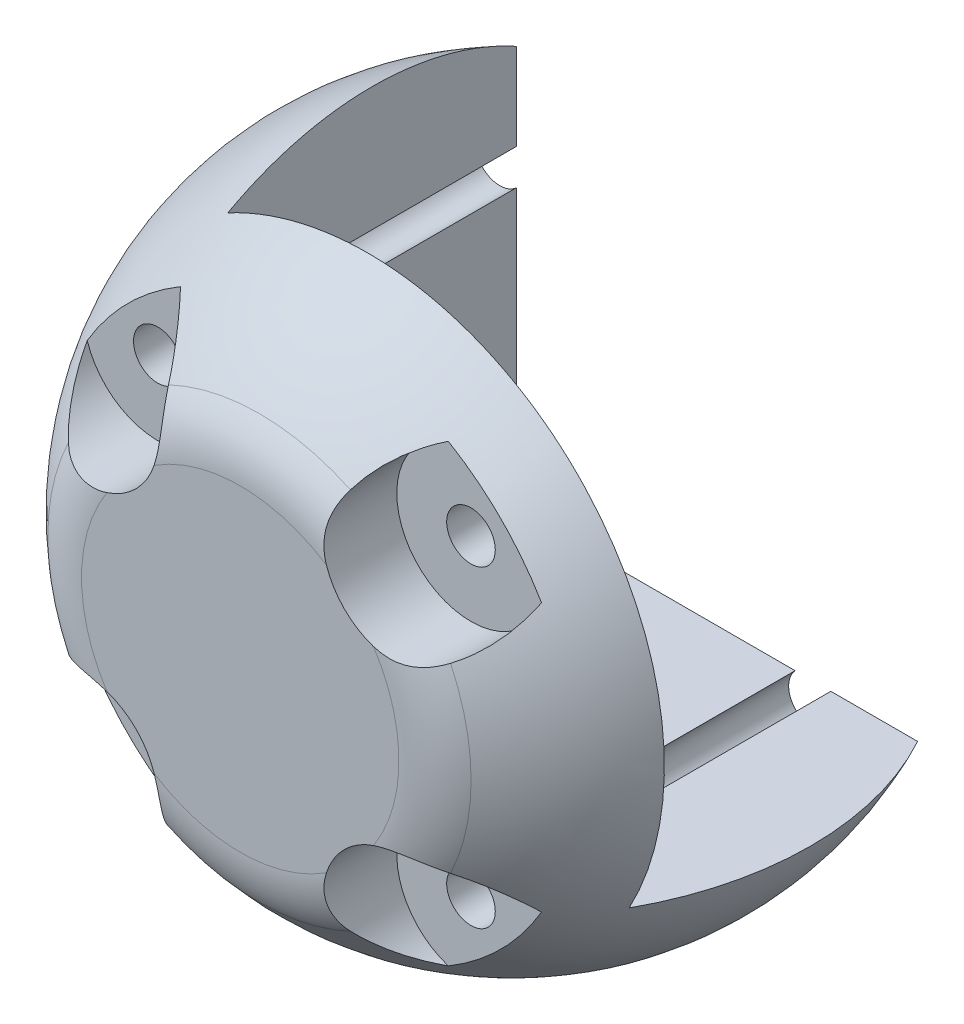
ISO-10303-21;
HEADER;
FILE_DESCRIPTION(('STEP AP214'),'2;1');
FILE_NAME('part.step','',(''),(''),'','','');
FILE_SCHEMA(('AUTOMOTIVE_DESIGN { 1 0 10303 214 1 1 1 1 }'));
ENDSEC;
DATA;
#1=APPLICATION_CONTEXT('core data for automotive mechanical design processes');
#2=APPLICATION_PROTOCOL_DEFINITION('international standard','automotive_design',2000,#1);
#3=PRODUCT_CONTEXT('',#1,'mechanical');
#4=PRODUCT('Part','Part','',(#3));
#5=PRODUCT_RELATED_PRODUCT_CATEGORY('part','',(#4));
#6=PRODUCT_DEFINITION_FORMATION('','',#4);
#7=PRODUCT_DEFINITION_CONTEXT('part definition',#1,'design');
#8=PRODUCT_DEFINITION('design','',#6,#7);
#9=PRODUCT_DEFINITION_SHAPE('','',#8);
#10=(LENGTH_UNIT() NAMED_UNIT(*) SI_UNIT(.MILLI.,.METRE.));
#11=(NAMED_UNIT(*) PLANE_ANGLE_UNIT() SI_UNIT($,.RADIAN.));
#12=(NAMED_UNIT(*) SI_UNIT($,.STERADIAN.) SOLID_ANGLE_UNIT());
#13=UNCERTAINTY_MEASURE_WITH_UNIT(LENGTH_MEASURE(1.E-05),#10,'distance_accuracy_value','');
#14=(GEOMETRIC_REPRESENTATION_CONTEXT(3) GLOBAL_UNCERTAINTY_ASSIGNED_CONTEXT((#13)) GLOBAL_UNIT_ASSIGNED_CONTEXT((#10,
#11,#12)) REPRESENTATION_CONTEXT('',''));
#15=CARTESIAN_POINT('',(0.,0.,0.));
#16=DIRECTION('',(0.,0.,1.));
#17=DIRECTION('',(1.,0.,0.));
#18=AXIS2_PLACEMENT_3D('',#15,#16,#17);
#19=CARTESIAN_POINT('',(-19.,-19.,-40.));
#20=DIRECTION('',(0.,0.,1.));
#21=DIRECTION('',(1.,0.,0.));
#22=AXIS2_PLACEMENT_3D('',#19,#20,#21);
#23=CYLINDRICAL_SURFACE('',#22,2.95);
#24=DIRECTION('',(0.,0.,1.));
#25=VECTOR('',#24,1.);
#26=CARTESIAN_POINT('',(-16.8314751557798,-17.,-40.));
#27=LINE('',#26,#25);
#28=CARTESIAN_POINT('',(-16.8314751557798,-17.,-17.5));
#29=VERTEX_POINT('',#28);
#30=CARTESIAN_POINT('',(-16.8314751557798,-17.,17.5));
#31=VERTEX_POINT('',#30);
#32=EDGE_CURVE('E206',#29,#31,#27,.T.);
#33=ORIENTED_EDGE('',*,*,#32,.F.);
#34=CARTESIAN_POINT('',(-19.,-19.,-17.5));
#35=DIRECTION('',(0.,0.,1.));
#36=DIRECTION('',(1.,0.,0.));
#37=AXIS2_PLACEMENT_3D('',#34,#35,#36);
#38=CIRCLE('',#37,2.95);
#39=CARTESIAN_POINT('',(-17.,-16.8314751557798,-17.5));
#40=VERTEX_POINT('',#39);
#41=EDGE_CURVE('E180',#29,#40,#38,.F.);
#42=ORIENTED_EDGE('',*,*,#41,.T.);
#43=DIRECTION('',(0.,0.,1.));
#44=VECTOR('',#43,1.);
#45=CARTESIAN_POINT('',(-17.,-16.8314751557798,-40.));
#46=LINE('',#45,#44);
#47=CARTESIAN_POINT('',(-17.,-16.8314751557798,17.5));
#48=VERTEX_POINT('',#47);
#49=EDGE_CURVE('E201',#48,#40,#46,.F.);
#50=ORIENTED_EDGE('',*,*,#49,.F.);
#51=CARTESIAN_POINT('',(-19.,-19.,17.5));
#52=DIRECTION('',(0.,0.,-1.));
#53=DIRECTION('',(-1.,0.,0.));
#54=AXIS2_PLACEMENT_3D('',#51,#52,#53);
#55=CIRCLE('',#54,2.95);
#56=EDGE_CURVE('E235',#48,#31,#55,.T.);
#57=ORIENTED_EDGE('',*,*,#56,.T.);
#58=EDGE_LOOP('',(#33,#42,#50,#57));
#59=FACE_BOUND('',#58,.T.);
#60=CARTESIAN_POINT('',(-19.,-19.,24.));
#61=DIRECTION('',(0.,0.,1.));
#62=DIRECTION('',(1.,0.,0.));
#63=AXIS2_PLACEMENT_3D('',#60,#61,#62);
#64=CIRCLE('',#63,2.95);
#65=CARTESIAN_POINT('',(-16.05,-19.,24.));
#66=VERTEX_POINT('',#65);
#67=EDGE_CURVE('E41',#66,#66,#64,.F.);
#68=ORIENTED_EDGE('',*,*,#67,.F.);
#69=EDGE_LOOP('',(#68));
#70=FACE_BOUND('',#69,.T.);
#71=ADVANCED_FACE('F36',(#59,#70),#23,.F.);
#72=CARTESIAN_POINT('',(19.,-19.,-40.));
#73=DIRECTION('',(0.,0.,1.));
#74=DIRECTION('',(1.,0.,0.));
#75=AXIS2_PLACEMENT_3D('',#72,#73,#74);
#76=CYLINDRICAL_SURFACE('',#75,2.95);
#77=DIRECTION('',(0.,0.,1.));
#78=VECTOR('',#77,1.);
#79=CARTESIAN_POINT('',(21.1685248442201,-17.,-40.));
#80=LINE('',#79,#78);
#81=CARTESIAN_POINT('',(21.1685248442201,-17.,-17.5));
#82=VERTEX_POINT('',#81);
#83=CARTESIAN_POINT('',(21.1685248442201,-17.,17.5));
#84=VERTEX_POINT('',#83);
#85=EDGE_CURVE('E194',#82,#84,#80,.T.);
#86=ORIENTED_EDGE('',*,*,#85,.F.);
#87=CARTESIAN_POINT('',(19.,-19.,-17.5));
#88=DIRECTION('',(0.,0.,1.));
#89=DIRECTION('',(1.,0.,0.));
#90=AXIS2_PLACEMENT_3D('',#87,#88,#89);
#91=CIRCLE('',#90,2.95);
#92=CARTESIAN_POINT('',(16.8314751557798,-17.,-17.5));
#93=VERTEX_POINT('',#92);
#94=EDGE_CURVE('E177',#82,#93,#91,.F.);
#95=ORIENTED_EDGE('',*,*,#94,.T.);
#96=DIRECTION('',(0.,0.,1.));
#97=VECTOR('',#96,1.);
#98=CARTESIAN_POINT('',(16.8314751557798,-17.,-40.));
#99=LINE('',#98,#97);
#100=CARTESIAN_POINT('',(16.8314751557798,-17.,17.5));
#101=VERTEX_POINT('',#100);
#102=EDGE_CURVE('E191',#101,#93,#99,.F.);
#103=ORIENTED_EDGE('',*,*,#102,.F.);
#104=CARTESIAN_POINT('',(19.,-19.,17.5));
#105=DIRECTION('',(0.,0.,-1.));
#106=DIRECTION('',(-1.,0.,0.));
#107=AXIS2_PLACEMENT_3D('',#104,#105,#106);
#108=CIRCLE('',#107,2.95);
#109=EDGE_CURVE('E237',#101,#84,#108,.T.);
#110=ORIENTED_EDGE('',*,*,#109,.T.);
#111=EDGE_LOOP('',(#86,#95,#103,#110));
#112=FACE_BOUND('',#111,.T.);
#113=CARTESIAN_POINT('',(19.,-19.,24.));
#114=DIRECTION('',(0.,0.,1.));
#115=DIRECTION('',(1.,0.,0.));
#116=AXIS2_PLACEMENT_3D('',#113,#114,#115);
#117=CIRCLE('',#116,2.95);
#118=CARTESIAN_POINT('',(21.95,-19.,24.));
#119=VERTEX_POINT('',#118);
#120=EDGE_CURVE('E370',#119,#119,#117,.F.);
#121=ORIENTED_EDGE('',*,*,#120,.F.);
#122=EDGE_LOOP('',(#121));
#123=FACE_BOUND('',#122,.T.);
#124=ADVANCED_FACE('F189',(#112,#123),#76,.F.);
#125=CARTESIAN_POINT('',(19.,19.,-40.));
#126=DIRECTION('',(0.,0.,1.));
#127=DIRECTION('',(1.,0.,0.));
#128=AXIS2_PLACEMENT_3D('',#125,#126,#127);
#129=CYLINDRICAL_SURFACE('',#128,2.95);
#130=CARTESIAN_POINT('',(19.,19.,17.5));
#131=DIRECTION('',(0.,0.,-1.));
#132=DIRECTION('',(-1.,0.,0.));
#133=AXIS2_PLACEMENT_3D('',#130,#131,#132);
#134=CIRCLE('',#133,2.95);
#135=CARTESIAN_POINT('',(16.05,19.,17.5));
#136=VERTEX_POINT('',#135);
#137=EDGE_CURVE('E203',#136,#136,#134,.T.);
#138=ORIENTED_EDGE('',*,*,#137,.T.);
#139=EDGE_LOOP('',(#138));
#140=FACE_BOUND('',#139,.T.);
#141=CARTESIAN_POINT('',(19.,19.,24.));
#142=DIRECTION('',(0.,0.,1.));
#143=DIRECTION('',(1.,0.,0.));
#144=AXIS2_PLACEMENT_3D('',#141,#142,#143);
#145=CIRCLE('',#144,2.95);
#146=CARTESIAN_POINT('',(21.95,19.,24.));
#147=VERTEX_POINT('',#146);
#148=EDGE_CURVE('E367',#147,#147,#145,.F.);
#149=ORIENTED_EDGE('',*,*,#148,.F.);
#150=EDGE_LOOP('',(#149));
#151=FACE_BOUND('',#150,.T.);
#152=ADVANCED_FACE('F491',(#140,#151),#129,.F.);
#153=CARTESIAN_POINT('',(0.,0.,23.));
#154=DIRECTION('',(0.,0.,1.));
#155=DIRECTION('',(0.,-1.,0.));
#156=AXIS2_PLACEMENT_3D('',#153,#154,#155);
#157=TOROIDAL_SURFACE('',#156,19.2613602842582,10.);
#158=CARTESIAN_POINT('',(11.1602364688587,23.4201931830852,30.4398449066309));
#159=CARTESIAN_POINT('',(11.0830084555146,23.2832460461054,30.580750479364));
#160=CARTESIAN_POINT('',(11.0072265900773,23.1404223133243,30.7168265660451));
#161=CARTESIAN_POINT('',(10.8601617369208,22.8432385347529,30.9786516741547));
#162=CARTESIAN_POINT('',(10.7888821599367,22.6888699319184,31.1043928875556));
#163=CARTESIAN_POINT('',(10.6523608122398,22.3685776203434,31.3449986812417));
#164=CARTESIAN_POINT('',(10.58713626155,22.2026231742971,31.459832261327));
#165=CARTESIAN_POINT('',(10.4646624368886,21.8602534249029,31.6774620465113));
#166=CARTESIAN_POINT('',(10.4074111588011,21.6838407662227,31.7802612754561));
#167=CARTESIAN_POINT('',(10.3022396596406,21.3205399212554,31.9737273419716));
#168=CARTESIAN_POINT('',(10.2543695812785,21.1336019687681,32.0643282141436));
#169=CARTESIAN_POINT('',(10.1698869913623,20.7514003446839,32.2323195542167));
#170=CARTESIAN_POINT('',(10.1332752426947,20.5561361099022,32.3097091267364));
#171=CARTESIAN_POINT('',(10.0727412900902,20.159402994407,32.4509310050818));
#172=CARTESIAN_POINT('',(10.048788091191,19.9579505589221,32.5147961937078));
#173=CARTESIAN_POINT('',(10.0145062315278,19.5502236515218,32.6293973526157));
#174=CARTESIAN_POINT('',(10.0041766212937,19.3439495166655,32.6801342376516));
#175=CARTESIAN_POINT('',(9.99810572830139,18.9430492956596,32.7659650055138));
#176=CARTESIAN_POINT('',(10.0013950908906,18.7486170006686,32.8019044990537));
#177=CARTESIAN_POINT('',(10.0207486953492,18.3588103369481,32.863731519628));
#178=CARTESIAN_POINT('',(10.0368123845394,18.1634360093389,32.8896194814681));
#179=CARTESIAN_POINT('',(10.081863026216,17.7730158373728,32.9324189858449));
#180=CARTESIAN_POINT('',(10.1108625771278,17.5779704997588,32.9493217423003));
#181=CARTESIAN_POINT('',(10.1817447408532,17.1896550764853,32.9753955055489));
#182=CARTESIAN_POINT('',(10.2236322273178,16.9963856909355,32.98456358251));
#183=CARTESIAN_POINT('',(10.3229851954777,16.6013902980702,32.9969530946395));
#184=CARTESIAN_POINT('',(10.381232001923,16.3998491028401,32.9997864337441));
#185=CARTESIAN_POINT('',(10.5116622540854,16.0013177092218,33.0001903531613));
#186=CARTESIAN_POINT('',(10.5838472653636,15.8043280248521,32.9977603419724));
#187=CARTESIAN_POINT('',(10.7417979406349,15.4158569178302,32.9894830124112));
#188=CARTESIAN_POINT('',(10.8275692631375,15.2243778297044,32.9836342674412));
#189=CARTESIAN_POINT('',(11.01222210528,14.8479707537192,32.9703055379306));
#190=CARTESIAN_POINT('',(11.1111008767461,14.6630414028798,32.962825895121));
#191=CARTESIAN_POINT('',(11.339405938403,14.2697360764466,32.9466020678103));
#192=CARTESIAN_POINT('',(11.4711683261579,14.0627106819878,32.9378588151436));
#193=CARTESIAN_POINT('',(11.7512063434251,13.6600431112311,32.9225566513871));
#194=CARTESIAN_POINT('',(11.8994831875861,13.4644017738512,32.9159979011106));
#195=CARTESIAN_POINT('',(12.2115356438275,13.0858732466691,32.9065540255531));
#196=CARTESIAN_POINT('',(12.3753073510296,12.9029828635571,32.9036679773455));
#197=CARTESIAN_POINT('',(12.717248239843,12.5511860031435,32.9021972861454));
#198=CARTESIAN_POINT('',(12.8954171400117,12.3822792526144,32.9036125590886));
#199=CARTESIAN_POINT('',(13.2683945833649,12.0565752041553,32.9105025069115));
#200=CARTESIAN_POINT('',(13.4634534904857,11.9000662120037,32.9160532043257));
#201=CARTESIAN_POINT('',(13.8658505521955,11.6038568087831,32.9300199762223));
#202=CARTESIAN_POINT('',(14.0731893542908,11.4641572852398,32.9384362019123));
#203=CARTESIAN_POINT('',(14.4990043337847,11.2023346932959,32.9560553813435));
#204=CARTESIAN_POINT('',(14.7174940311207,11.0802336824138,32.9652592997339));
#205=CARTESIAN_POINT('',(15.1639470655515,10.8546176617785,32.9817668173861));
#206=CARTESIAN_POINT('',(15.3919105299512,10.7511029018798,32.9890703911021));
#207=CARTESIAN_POINT('',(15.8590204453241,10.5620735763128,32.9988208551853));
#208=CARTESIAN_POINT('',(16.0982786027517,10.4768305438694,33.0011985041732));
#209=CARTESIAN_POINT('',(16.5830790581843,10.3268895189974,32.997610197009));
#210=CARTESIAN_POINT('',(16.8286202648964,10.2621879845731,32.9916456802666));
#211=CARTESIAN_POINT('',(17.3233419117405,10.1539385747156,32.9682193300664));
#212=CARTESIAN_POINT('',(17.5725146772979,10.11035131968,32.9507790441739));
#213=CARTESIAN_POINT('',(18.072259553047,10.0443996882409,32.9015892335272));
#214=CARTESIAN_POINT('',(18.3228313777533,10.0220311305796,32.8698425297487));
#215=CARTESIAN_POINT('',(18.7953946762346,9.99955974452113,32.7940941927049));
#216=CARTESIAN_POINT('',(19.0175563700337,9.99731737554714,32.7517817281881));
#217=CARTESIAN_POINT('',(19.458247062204,10.0089723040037,32.652841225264));
#218=CARTESIAN_POINT('',(19.6767762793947,10.0228686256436,32.5962140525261));
#219=CARTESIAN_POINT('',(20.1079171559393,10.0658257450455,32.4680191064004));
#220=CARTESIAN_POINT('',(20.3205278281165,10.0948890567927,32.3964488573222));
#221=CARTESIAN_POINT('',(20.7376439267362,10.1668025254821,32.2382610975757));
#222=CARTESIAN_POINT('',(20.9421500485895,10.2096514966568,32.1516448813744));
#223=CARTESIAN_POINT('',(21.3160178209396,10.3012469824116,31.9755694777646));
#224=CARTESIAN_POINT('',(21.4865562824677,10.3485654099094,31.8878506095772));
#225=CARTESIAN_POINT('',(21.8191169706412,10.4511487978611,31.7015819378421));
#226=CARTESIAN_POINT('',(21.981138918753,10.5064140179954,31.603031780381));
#227=CARTESIAN_POINT('',(22.2957993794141,10.6234927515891,31.395729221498));
#228=CARTESIAN_POINT('',(22.448445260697,10.6853010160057,31.2869850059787));
#229=CARTESIAN_POINT('',(22.7439735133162,10.8141198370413,31.059854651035));
#230=CARTESIAN_POINT('',(22.886859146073,10.8811286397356,30.9414717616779));
#231=CARTESIAN_POINT('',(23.0931686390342,10.9842759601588,30.757582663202));
#232=CARTESIAN_POINT('',(23.1603782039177,11.0189700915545,30.6954645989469));
#233=CARTESIAN_POINT('',(23.292198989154,11.0890841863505,30.5691899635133));
#234=CARTESIAN_POINT('',(23.3568146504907,11.1245027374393,30.5050372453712));
#235=CARTESIAN_POINT('',(23.420193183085,11.1602364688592,30.4398449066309));
#236=B_SPLINE_CURVE_WITH_KNOTS('',3,(#158,#159,#160,#161,#162,#163,#164,#165,#166,#167,#168,
#169,#170,#171,#172,#173,#174,#175,#176,#177,#178,#179,#180,#181,#182,#183,#184,#185,#186,#187,
#188,#189,#190,#191,#192,#193,#194,#195,#196,#197,#198,#199,#200,#201,#202,#203,#204,#205,#206,
#207,#208,#209,#210,#211,#212,#213,#214,#215,#216,#217,#218,#219,#220,#221,#222,#223,#224,#225,
#226,#227,#228,#229,#230,#231,#232,#233,#234,#235),.UNSPECIFIED.,.F.,.F.,(4,2,2,2,2,2,2,2,2,2,2,
2,2,2,2,2,2,2,2,2,2,2,2,2,2,2,2,2,2,2,2,2,2,2,2,2,2,2,4),(0.,0.633319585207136,1.26711332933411,
1.90265759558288,2.53804182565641,3.17673473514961,3.81547091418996,4.45263578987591,
5.08975625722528,5.68233710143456,6.27489230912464,6.86802587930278,7.4613840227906,
8.09019983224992,8.71908631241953,9.34823540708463,9.97725279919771,10.713076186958,
11.4489537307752,12.1846463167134,12.9203245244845,13.669871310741,14.4194576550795,
15.1699754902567,15.9205034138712,16.6815114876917,17.4423882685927,18.2018404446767,
18.9611429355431,19.6386258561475,20.3160678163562,20.9936221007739,21.6711181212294,
22.2630579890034,22.8550172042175,23.4465050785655,24.0377943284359,24.3313690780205,
24.6244176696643),.UNSPECIFIED.);
#237=CARTESIAN_POINT('',(11.0349403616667,23.1902058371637,30.6666666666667));
#238=VERTEX_POINT('',#237);
#239=CARTESIAN_POINT('',(10.454015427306,16.1775635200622,33.));
#240=VERTEX_POINT('',#239);
#241=EDGE_CURVE('E12',#238,#240,#236,.T.);
#242=ORIENTED_EDGE('',*,*,#241,.F.);
#243=CARTESIAN_POINT('',(0.,0.,30.6666666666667));
#244=DIRECTION('',(0.,0.,-1.));
#245=DIRECTION('',(0.,1.,0.));
#246=AXIS2_PLACEMENT_3D('',#243,#244,#245);
#247=CIRCLE('',#246,25.6818137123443);
#248=CARTESIAN_POINT('',(-11.034940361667,23.1902058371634,30.6666666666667));
#249=VERTEX_POINT('',#248);
#250=EDGE_CURVE('E249',#249,#238,#247,.T.);
#251=ORIENTED_EDGE('',*,*,#250,.F.);
#252=CARTESIAN_POINT('',(-23.420193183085,11.160236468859,30.4398449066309));
#253=CARTESIAN_POINT('',(-23.2832460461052,11.0830084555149,30.580750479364));
#254=CARTESIAN_POINT('',(-23.1404223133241,11.0072265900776,30.7168265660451));
#255=CARTESIAN_POINT('',(-22.8432385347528,10.8601617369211,30.9786516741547));
#256=CARTESIAN_POINT('',(-22.6888699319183,10.788882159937,31.1043928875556));
#257=CARTESIAN_POINT('',(-22.3685776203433,10.6523608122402,31.3449986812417));
#258=CARTESIAN_POINT('',(-22.2026231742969,10.5871362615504,31.459832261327));
#259=CARTESIAN_POINT('',(-21.8602534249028,10.4646624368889,31.6774620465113));
#260=CARTESIAN_POINT('',(-21.6838407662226,10.4074111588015,31.7802612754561));
#261=CARTESIAN_POINT('',(-21.3205399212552,10.3022396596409,31.9737273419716));
#262=CARTESIAN_POINT('',(-21.1336019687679,10.2543695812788,32.0643282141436));
#263=CARTESIAN_POINT('',(-20.7514003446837,10.1698869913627,32.2323195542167));
#264=CARTESIAN_POINT('',(-20.5561361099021,10.1332752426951,32.3097091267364));
#265=CARTESIAN_POINT('',(-20.1594029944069,10.0727412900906,32.4509310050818));
#266=CARTESIAN_POINT('',(-19.9579505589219,10.0487880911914,32.5147961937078));
#267=CARTESIAN_POINT('',(-19.5502236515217,10.0145062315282,32.6293973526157));
#268=CARTESIAN_POINT('',(-19.3439495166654,10.0041766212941,32.6801342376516));
#269=CARTESIAN_POINT('',(-18.9430492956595,9.99810572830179,32.7659650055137));
#270=CARTESIAN_POINT('',(-18.7486170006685,10.001395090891,32.8019044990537));
#271=CARTESIAN_POINT('',(-18.3588103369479,10.0207486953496,32.863731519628));
#272=CARTESIAN_POINT('',(-18.1634360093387,10.0368123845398,32.8896194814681));
#273=CARTESIAN_POINT('',(-17.7730158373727,10.0818630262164,32.9324189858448));
#274=CARTESIAN_POINT('',(-17.5779704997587,10.1108625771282,32.9493217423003));
#275=CARTESIAN_POINT('',(-17.1896550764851,10.1817447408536,32.9753955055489));
#276=CARTESIAN_POINT('',(-16.9963856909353,10.2236322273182,32.9845635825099));
#277=CARTESIAN_POINT('',(-16.60139029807,10.3229851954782,32.9969530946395));
#278=CARTESIAN_POINT('',(-16.3998491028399,10.3812320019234,32.9997864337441));
#279=CARTESIAN_POINT('',(-16.0013177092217,10.5116622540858,33.0001903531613));
#280=CARTESIAN_POINT('',(-15.8043280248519,10.5838472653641,32.9977603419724));
#281=CARTESIAN_POINT('',(-15.41585691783,10.7417979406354,32.9894830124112));
#282=CARTESIAN_POINT('',(-15.2243778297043,10.827569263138,32.9836342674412));
#283=CARTESIAN_POINT('',(-14.847970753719,11.0122221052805,32.9703055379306));
#284=CARTESIAN_POINT('',(-14.6630414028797,11.1111008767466,32.962825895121));
#285=CARTESIAN_POINT('',(-14.2697360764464,11.3394059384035,32.9466020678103));
#286=CARTESIAN_POINT('',(-14.0627106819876,11.4711683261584,32.9378588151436));
#287=CARTESIAN_POINT('',(-13.660043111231,11.7512063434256,32.9225566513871));
#288=CARTESIAN_POINT('',(-13.464401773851,11.8994831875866,32.9159979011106));
#289=CARTESIAN_POINT('',(-13.085873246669,12.211535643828,32.9065540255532));
#290=CARTESIAN_POINT('',(-12.9029828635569,12.3753073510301,32.9036679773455));
#291=CARTESIAN_POINT('',(-12.5511860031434,12.7172482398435,32.9021972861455));
#292=CARTESIAN_POINT('',(-12.3822792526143,12.8954171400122,32.9036125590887));
#293=CARTESIAN_POINT('',(-12.0565752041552,13.2683945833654,32.9105025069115));
#294=CARTESIAN_POINT('',(-11.9000662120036,13.4634534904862,32.9160532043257));
#295=CARTESIAN_POINT('',(-11.603856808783,13.8658505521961,32.9300199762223));
#296=CARTESIAN_POINT('',(-11.4641572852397,14.0731893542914,32.9384362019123));
#297=CARTESIAN_POINT('',(-11.2023346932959,14.4990043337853,32.9560553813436));
#298=CARTESIAN_POINT('',(-11.0802336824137,14.7174940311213,32.965259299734));
#299=CARTESIAN_POINT('',(-10.8546176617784,15.163947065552,32.9817668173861));
#300=CARTESIAN_POINT('',(-10.7511029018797,15.3919105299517,32.9890703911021));
#301=CARTESIAN_POINT('',(-10.5620735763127,15.8590204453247,32.9988208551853));
#302=CARTESIAN_POINT('',(-10.4768305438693,16.0982786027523,33.0011985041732));
#303=CARTESIAN_POINT('',(-10.3268895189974,16.5830790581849,32.997610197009));
#304=CARTESIAN_POINT('',(-10.2621879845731,16.828620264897,32.9916456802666));
#305=CARTESIAN_POINT('',(-10.1539385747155,17.323341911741,32.9682193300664));
#306=CARTESIAN_POINT('',(-10.11035131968,17.5725146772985,32.9507790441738));
#307=CARTESIAN_POINT('',(-10.0443996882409,18.0722595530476,32.9015892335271));
#308=CARTESIAN_POINT('',(-10.0220311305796,18.3228313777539,32.8698425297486));
#309=CARTESIAN_POINT('',(-9.99955974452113,18.7953946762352,32.7940941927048));
#310=CARTESIAN_POINT('',(-9.99731737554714,19.0175563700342,32.751781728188));
#311=CARTESIAN_POINT('',(-10.0089723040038,19.4582470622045,32.6528412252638));
#312=CARTESIAN_POINT('',(-10.0228686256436,19.6767762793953,32.596214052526));
#313=CARTESIAN_POINT('',(-10.0658257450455,20.1079171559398,32.4680191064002));
#314=CARTESIAN_POINT('',(-10.0948890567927,20.320527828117,32.396448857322));
#315=CARTESIAN_POINT('',(-10.1668025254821,20.7376439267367,32.2382610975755));
#316=CARTESIAN_POINT('',(-10.2096514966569,20.9421500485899,32.1516448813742));
#317=CARTESIAN_POINT('',(-10.3012469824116,21.3160178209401,31.9755694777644));
#318=CARTESIAN_POINT('',(-10.3485654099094,21.4865562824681,31.887850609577));
#319=CARTESIAN_POINT('',(-10.4511487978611,21.8191169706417,31.7015819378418));
#320=CARTESIAN_POINT('',(-10.5064140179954,21.9811389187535,31.6030317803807));
#321=CARTESIAN_POINT('',(-10.6234927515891,22.2957993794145,31.3957292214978));
#322=CARTESIAN_POINT('',(-10.6853010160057,22.4484452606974,31.2869850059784));
#323=CARTESIAN_POINT('',(-10.8141198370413,22.7439735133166,31.0598546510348));
#324=CARTESIAN_POINT('',(-10.8811286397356,22.8868591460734,30.9414717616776));
#325=CARTESIAN_POINT('',(-10.9842759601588,23.0931686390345,30.7575826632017));
#326=CARTESIAN_POINT('',(-11.0189700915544,23.1603782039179,30.6954645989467));
#327=CARTESIAN_POINT('',(-11.0890841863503,23.2921989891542,30.5691899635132));
#328=CARTESIAN_POINT('',(-11.1245027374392,23.3568146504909,30.5050372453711));
#329=CARTESIAN_POINT('',(-11.160236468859,23.420193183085,30.4398449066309));
#330=B_SPLINE_CURVE_WITH_KNOTS('',3,(#252,#253,#254,#255,#256,#257,#258,#259,#260,#261,#262,
#263,#264,#265,#266,#267,#268,#269,#270,#271,#272,#273,#274,#275,#276,#277,#278,#279,#280,#281,
#282,#283,#284,#285,#286,#287,#288,#289,#290,#291,#292,#293,#294,#295,#296,#297,#298,#299,#300,
#301,#302,#303,#304,#305,#306,#307,#308,#309,#310,#311,#312,#313,#314,#315,#316,#317,#318,#319,
#320,#321,#322,#323,#324,#325,#326,#327,#328,#329),.UNSPECIFIED.,.F.,.F.,(4,2,2,2,2,2,2,2,2,2,2,
2,2,2,2,2,2,2,2,2,2,2,2,2,2,2,2,2,2,2,2,2,2,2,2,2,2,2,4),(0.,0.633319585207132,1.2671133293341,
1.90265759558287,2.53804182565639,3.17673473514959,3.81547091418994,4.45263578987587,
5.08975625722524,5.68233710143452,6.27489230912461,6.86802587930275,7.46138402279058,
8.0901998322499,8.71908631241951,9.34823540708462,9.97725279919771,10.713076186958,
11.4489537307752,12.1846463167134,12.9203245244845,13.669871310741,14.4194576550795,
15.1699754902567,15.9205034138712,16.6815114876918,17.4423882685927,18.2018404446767,
18.9611429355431,19.6386258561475,20.3160678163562,20.9936221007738,21.6711181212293,
22.2630579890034,22.8550172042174,23.4465050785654,24.0377943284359,24.3313690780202,
24.6244176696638),.UNSPECIFIED.);
#331=CARTESIAN_POINT('',(-10.4540154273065,16.1775635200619,33.));
#332=VERTEX_POINT('',#331);
#333=EDGE_CURVE('E256',#332,#249,#330,.T.);
#334=ORIENTED_EDGE('',*,*,#333,.F.);
#335=CARTESIAN_POINT('',(0.,0.,33.));
#336=DIRECTION('',(0.,0.,1.));
#337=DIRECTION('',(0.,-1.,0.));
#338=AXIS2_PLACEMENT_3D('',#335,#336,#337);
#339=CIRCLE('',#338,19.2613602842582);
#340=EDGE_CURVE('E252',#240,#332,#339,.T.);
#341=ORIENTED_EDGE('',*,*,#340,.F.);
#342=EDGE_LOOP('',(#242,#251,#334,#341));
#343=FACE_BOUND('',#342,.T.);
#344=ADVANCED_FACE('F398',(#343),#157,.T.);
#345=CARTESIAN_POINT('',(16.177563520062,10.4540154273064,33.));
#346=VERTEX_POINT('',#345);
#347=CARTESIAN_POINT('',(23.1902058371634,11.0349403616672,30.6666666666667));
#348=VERTEX_POINT('',#347);
#349=EDGE_CURVE('E46',#346,#348,#236,.T.);
#350=ORIENTED_EDGE('',*,*,#349,.F.);
#351=CARTESIAN_POINT('',(16.1775635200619,-10.4540154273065,33.));
#352=VERTEX_POINT('',#351);
#353=EDGE_CURVE('E461',#352,#346,#339,.T.);
#354=ORIENTED_EDGE('',*,*,#353,.F.);
#355=CARTESIAN_POINT('',(23.420193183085,-11.160236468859,30.4398449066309));
#356=CARTESIAN_POINT('',(23.2832460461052,-11.0830084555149,30.580750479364));
#357=CARTESIAN_POINT('',(23.1404223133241,-11.0072265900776,30.7168265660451));
#358=CARTESIAN_POINT('',(22.8432385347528,-10.8601617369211,30.9786516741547));
#359=CARTESIAN_POINT('',(22.6888699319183,-10.788882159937,31.1043928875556));
#360=CARTESIAN_POINT('',(22.3685776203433,-10.6523608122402,31.3449986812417));
#361=CARTESIAN_POINT('',(22.2026231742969,-10.5871362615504,31.459832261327));
#362=CARTESIAN_POINT('',(21.8602534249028,-10.4646624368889,31.6774620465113));
#363=CARTESIAN_POINT('',(21.6838407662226,-10.4074111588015,31.7802612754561));
#364=CARTESIAN_POINT('',(21.3205399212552,-10.3022396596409,31.9737273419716));
#365=CARTESIAN_POINT('',(21.1336019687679,-10.2543695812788,32.0643282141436));
#366=CARTESIAN_POINT('',(20.7514003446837,-10.1698869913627,32.2323195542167));
#367=CARTESIAN_POINT('',(20.556136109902,-10.1332752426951,32.3097091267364));
#368=CARTESIAN_POINT('',(20.1594029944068,-10.0727412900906,32.4509310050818));
#369=CARTESIAN_POINT('',(19.9579505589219,-10.0487880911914,32.5147961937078));
#370=CARTESIAN_POINT('',(19.5502236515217,-10.0145062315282,32.6293973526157));
#371=CARTESIAN_POINT('',(19.3439495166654,-10.0041766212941,32.6801342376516));
#372=CARTESIAN_POINT('',(18.9430492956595,-9.99810572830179,32.7659650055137));
#373=CARTESIAN_POINT('',(18.7486170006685,-10.001395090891,32.8019044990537));
#374=CARTESIAN_POINT('',(18.3588103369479,-10.0207486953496,32.863731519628));
#375=CARTESIAN_POINT('',(18.1634360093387,-10.0368123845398,32.8896194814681));
#376=CARTESIAN_POINT('',(17.7730158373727,-10.0818630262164,32.9324189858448));
#377=CARTESIAN_POINT('',(17.5779704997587,-10.1108625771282,32.9493217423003));
#378=CARTESIAN_POINT('',(17.1896550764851,-10.1817447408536,32.9753955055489));
#379=CARTESIAN_POINT('',(16.9963856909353,-10.2236322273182,32.9845635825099));
#380=CARTESIAN_POINT('',(16.60139029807,-10.3229851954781,32.9969530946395));
#381=CARTESIAN_POINT('',(16.3998491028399,-10.3812320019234,32.9997864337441));
#382=CARTESIAN_POINT('',(16.0013177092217,-10.5116622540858,33.0001903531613));
#383=CARTESIAN_POINT('',(15.8043280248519,-10.5838472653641,32.9977603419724));
#384=CARTESIAN_POINT('',(15.41585691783,-10.7417979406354,32.9894830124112));
#385=CARTESIAN_POINT('',(15.2243778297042,-10.827569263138,32.9836342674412));
#386=CARTESIAN_POINT('',(14.847970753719,-11.0122221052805,32.9703055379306));
#387=CARTESIAN_POINT('',(14.6630414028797,-11.1111008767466,32.962825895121));
#388=CARTESIAN_POINT('',(14.2697360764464,-11.3394059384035,32.9466020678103));
#389=CARTESIAN_POINT('',(14.0627106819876,-11.4711683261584,32.9378588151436));
#390=CARTESIAN_POINT('',(13.660043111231,-11.7512063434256,32.9225566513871));
#391=CARTESIAN_POINT('',(13.464401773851,-11.8994831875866,32.9159979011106));
#392=CARTESIAN_POINT('',(13.085873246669,-12.211535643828,32.9065540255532));
#393=CARTESIAN_POINT('',(12.9029828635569,-12.3753073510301,32.9036679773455));
#394=CARTESIAN_POINT('',(12.5511860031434,-12.7172482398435,32.9021972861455));
#395=CARTESIAN_POINT('',(12.3822792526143,-12.8954171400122,32.9036125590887));
#396=CARTESIAN_POINT('',(12.0565752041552,-13.2683945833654,32.9105025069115));
#397=CARTESIAN_POINT('',(11.9000662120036,-13.4634534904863,32.9160532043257));
#398=CARTESIAN_POINT('',(11.603856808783,-13.8658505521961,32.9300199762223));
#399=CARTESIAN_POINT('',(11.4641572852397,-14.0731893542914,32.9384362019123));
#400=CARTESIAN_POINT('',(11.2023346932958,-14.4990043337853,32.9560553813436));
#401=CARTESIAN_POINT('',(11.0802336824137,-14.7174940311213,32.965259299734));
#402=CARTESIAN_POINT('',(10.8546176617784,-15.1639470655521,32.9817668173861));
#403=CARTESIAN_POINT('',(10.7511029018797,-15.3919105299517,32.9890703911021));
#404=CARTESIAN_POINT('',(10.5620735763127,-15.8590204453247,32.9988208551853));
#405=CARTESIAN_POINT('',(10.4768305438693,-16.0982786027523,33.0011985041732));
#406=CARTESIAN_POINT('',(10.3268895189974,-16.5830790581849,32.997610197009));
#407=CARTESIAN_POINT('',(10.2621879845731,-16.828620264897,32.9916456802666));
#408=CARTESIAN_POINT('',(10.1539385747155,-17.3233419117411,32.9682193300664));
#409=CARTESIAN_POINT('',(10.11035131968,-17.5725146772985,32.9507790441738));
#410=CARTESIAN_POINT('',(10.0443996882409,-18.0722595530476,32.9015892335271));
#411=CARTESIAN_POINT('',(10.0220311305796,-18.3228313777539,32.8698425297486));
#412=CARTESIAN_POINT('',(9.99955974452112,-18.7953946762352,32.7940941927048));
#413=CARTESIAN_POINT('',(9.99731737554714,-19.0175563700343,32.751781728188));
#414=CARTESIAN_POINT('',(10.0089723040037,-19.4582470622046,32.6528412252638));
#415=CARTESIAN_POINT('',(10.0228686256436,-19.6767762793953,32.596214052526));
#416=CARTESIAN_POINT('',(10.0658257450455,-20.1079171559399,32.4680191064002));
#417=CARTESIAN_POINT('',(10.0948890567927,-20.3205278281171,32.396448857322));
#418=CARTESIAN_POINT('',(10.1668025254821,-20.7376439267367,32.2382610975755));
#419=CARTESIAN_POINT('',(10.2096514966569,-20.9421500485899,32.1516448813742));
#420=CARTESIAN_POINT('',(10.3012469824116,-21.3160178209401,31.9755694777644));
#421=CARTESIAN_POINT('',(10.3485654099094,-21.4865562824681,31.887850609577));
#422=CARTESIAN_POINT('',(10.4511487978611,-21.8191169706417,31.7015819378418));
#423=CARTESIAN_POINT('',(10.5064140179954,-21.9811389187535,31.6030317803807));
#424=CARTESIAN_POINT('',(10.6234927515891,-22.2957993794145,31.3957292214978));
#425=CARTESIAN_POINT('',(10.6853010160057,-22.4484452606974,31.2869850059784));
#426=CARTESIAN_POINT('',(10.8141198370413,-22.7439735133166,31.0598546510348));
#427=CARTESIAN_POINT('',(10.8811286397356,-22.8868591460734,30.9414717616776));
#428=CARTESIAN_POINT('',(10.9842759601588,-23.0931686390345,30.7575826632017));
#429=CARTESIAN_POINT('',(11.0189700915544,-23.160378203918,30.6954645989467));
#430=CARTESIAN_POINT('',(11.0890841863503,-23.2921989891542,30.5691899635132));
#431=CARTESIAN_POINT('',(11.1245027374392,-23.3568146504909,30.5050372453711));
#432=CARTESIAN_POINT('',(11.160236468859,-23.420193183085,30.4398449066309));
#433=B_SPLINE_CURVE_WITH_KNOTS('',3,(#355,#356,#357,#358,#359,#360,#361,#362,#363,#364,#365,
#366,#367,#368,#369,#370,#371,#372,#373,#374,#375,#376,#377,#378,#379,#380,#381,#382,#383,#384,
#385,#386,#387,#388,#389,#390,#391,#392,#393,#394,#395,#396,#397,#398,#399,#400,#401,#402,#403,
#404,#405,#406,#407,#408,#409,#410,#411,#412,#413,#414,#415,#416,#417,#418,#419,#420,#421,#422,
#423,#424,#425,#426,#427,#428,#429,#430,#431,#432),.UNSPECIFIED.,.F.,.F.,(4,2,2,2,2,2,2,2,2,2,2,
2,2,2,2,2,2,2,2,2,2,2,2,2,2,2,2,2,2,2,2,2,2,2,2,2,2,2,4),(0.,0.633319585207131,1.2671133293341,
1.90265759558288,2.5380418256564,3.1767347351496,3.81547091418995,4.45263578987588,
5.08975625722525,5.68233710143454,6.27489230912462,6.86802587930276,7.46138402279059,
8.09019983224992,8.71908631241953,9.34823540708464,9.97725279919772,10.713076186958,
11.4489537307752,12.1846463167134,12.9203245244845,13.6698713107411,14.4194576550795,
15.1699754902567,15.9205034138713,16.6815114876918,17.4423882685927,18.2018404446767,
18.9611429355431,19.6386258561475,20.3160678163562,20.9936221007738,21.6711181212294,
22.2630579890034,22.8550172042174,23.4465050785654,24.0377943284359,24.3313690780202,
24.6244176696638),.UNSPECIFIED.);
#434=CARTESIAN_POINT('',(23.1902058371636,-11.034940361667,30.6666666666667));
#435=VERTEX_POINT('',#434);
#436=EDGE_CURVE('E362',#435,#352,#433,.T.);
#437=ORIENTED_EDGE('',*,*,#436,.F.);
#438=CARTESIAN_POINT('',(0.,0.,30.6666666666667));
#439=DIRECTION('',(0.,0.,-1.));
#440=DIRECTION('',(0.,1.,0.));
#441=AXIS2_PLACEMENT_3D('',#438,#439,#440);
#442=CIRCLE('',#441,25.6818137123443);
#443=EDGE_CURVE('E246',#348,#435,#442,.T.);
#444=ORIENTED_EDGE('',*,*,#443,.F.);
#445=EDGE_LOOP('',(#350,#354,#437,#444));
#446=FACE_BOUND('',#445,.T.);
#447=ADVANCED_FACE('F459',(#446),#157,.T.);
#448=CARTESIAN_POINT('',(10.4540154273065,-16.1775635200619,33.));
#449=VERTEX_POINT('',#448);
#450=CARTESIAN_POINT('',(11.034940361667,-23.1902058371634,30.6666666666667));
#451=VERTEX_POINT('',#450);
#452=EDGE_CURVE('E363',#449,#451,#433,.T.);
#453=ORIENTED_EDGE('',*,*,#452,.F.);
#454=CARTESIAN_POINT('',(-10.454015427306,-16.1775635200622,33.));
#455=VERTEX_POINT('',#454);
#456=EDGE_CURVE('E257',#455,#449,#339,.T.);
#457=ORIENTED_EDGE('',*,*,#456,.F.);
#458=CARTESIAN_POINT('',(-11.1602364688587,-23.4201931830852,30.4398449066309));
#459=CARTESIAN_POINT('',(-11.0830084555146,-23.2832460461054,30.580750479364));
#460=CARTESIAN_POINT('',(-11.0072265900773,-23.1404223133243,30.7168265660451));
#461=CARTESIAN_POINT('',(-10.8601617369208,-22.8432385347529,30.9786516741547));
#462=CARTESIAN_POINT('',(-10.7888821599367,-22.6888699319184,31.1043928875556));
#463=CARTESIAN_POINT('',(-10.6523608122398,-22.3685776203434,31.3449986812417));
#464=CARTESIAN_POINT('',(-10.58713626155,-22.2026231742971,31.459832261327));
#465=CARTESIAN_POINT('',(-10.4646624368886,-21.8602534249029,31.6774620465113));
#466=CARTESIAN_POINT('',(-10.4074111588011,-21.6838407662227,31.7802612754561));
#467=CARTESIAN_POINT('',(-10.3022396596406,-21.3205399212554,31.9737273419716));
#468=CARTESIAN_POINT('',(-10.2543695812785,-21.1336019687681,32.0643282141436));
#469=CARTESIAN_POINT('',(-10.1698869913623,-20.7514003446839,32.2323195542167));
#470=CARTESIAN_POINT('',(-10.1332752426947,-20.5561361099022,32.3097091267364));
#471=CARTESIAN_POINT('',(-10.0727412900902,-20.159402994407,32.4509310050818));
#472=CARTESIAN_POINT('',(-10.048788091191,-19.9579505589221,32.5147961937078));
#473=CARTESIAN_POINT('',(-10.0145062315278,-19.5502236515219,32.6293973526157));
#474=CARTESIAN_POINT('',(-10.0041766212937,-19.3439495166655,32.6801342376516));
#475=CARTESIAN_POINT('',(-9.99810572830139,-18.9430492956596,32.7659650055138));
#476=CARTESIAN_POINT('',(-10.0013950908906,-18.7486170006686,32.8019044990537));
#477=CARTESIAN_POINT('',(-10.0207486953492,-18.3588103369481,32.863731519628));
#478=CARTESIAN_POINT('',(-10.0368123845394,-18.1634360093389,32.8896194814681));
#479=CARTESIAN_POINT('',(-10.081863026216,-17.7730158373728,32.9324189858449));
#480=CARTESIAN_POINT('',(-10.1108625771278,-17.5779704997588,32.9493217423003));
#481=CARTESIAN_POINT('',(-10.1817447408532,-17.1896550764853,32.9753955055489));
#482=CARTESIAN_POINT('',(-10.2236322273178,-16.9963856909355,32.98456358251));
#483=CARTESIAN_POINT('',(-10.3229851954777,-16.6013902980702,32.9969530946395));
#484=CARTESIAN_POINT('',(-10.381232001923,-16.3998491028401,32.9997864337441));
#485=CARTESIAN_POINT('',(-10.5116622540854,-16.0013177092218,33.0001903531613));
#486=CARTESIAN_POINT('',(-10.5838472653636,-15.8043280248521,32.9977603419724));
#487=CARTESIAN_POINT('',(-10.7417979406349,-15.4158569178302,32.9894830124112));
#488=CARTESIAN_POINT('',(-10.8275692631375,-15.2243778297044,32.9836342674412));
#489=CARTESIAN_POINT('',(-11.01222210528,-14.8479707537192,32.9703055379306));
#490=CARTESIAN_POINT('',(-11.1111008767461,-14.6630414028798,32.962825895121));
#491=CARTESIAN_POINT('',(-11.339405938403,-14.2697360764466,32.9466020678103));
#492=CARTESIAN_POINT('',(-11.4711683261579,-14.0627106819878,32.9378588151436));
#493=CARTESIAN_POINT('',(-11.7512063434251,-13.6600431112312,32.9225566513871));
#494=CARTESIAN_POINT('',(-11.8994831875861,-13.4644017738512,32.9159979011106));
#495=CARTESIAN_POINT('',(-12.2115356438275,-13.0858732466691,32.9065540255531));
#496=CARTESIAN_POINT('',(-12.3753073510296,-12.9029828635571,32.9036679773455));
#497=CARTESIAN_POINT('',(-12.717248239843,-12.5511860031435,32.9021972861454));
#498=CARTESIAN_POINT('',(-12.8954171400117,-12.3822792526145,32.9036125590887));
#499=CARTESIAN_POINT('',(-13.2683945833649,-12.0565752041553,32.9105025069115));
#500=CARTESIAN_POINT('',(-13.4634534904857,-11.9000662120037,32.9160532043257));
#501=CARTESIAN_POINT('',(-13.8658505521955,-11.6038568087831,32.9300199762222));
#502=CARTESIAN_POINT('',(-14.0731893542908,-11.4641572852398,32.9384362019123));
#503=CARTESIAN_POINT('',(-14.4990043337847,-11.202334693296,32.9560553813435));
#504=CARTESIAN_POINT('',(-14.7174940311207,-11.0802336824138,32.9652592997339));
#505=CARTESIAN_POINT('',(-15.1639470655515,-10.8546176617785,32.9817668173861));
#506=CARTESIAN_POINT('',(-15.3919105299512,-10.7511029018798,32.9890703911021));
#507=CARTESIAN_POINT('',(-15.8590204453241,-10.5620735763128,32.9988208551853));
#508=CARTESIAN_POINT('',(-16.0982786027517,-10.4768305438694,33.0011985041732));
#509=CARTESIAN_POINT('',(-16.5830790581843,-10.3268895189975,32.997610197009));
#510=CARTESIAN_POINT('',(-16.8286202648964,-10.2621879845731,32.9916456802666));
#511=CARTESIAN_POINT('',(-17.3233419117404,-10.1539385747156,32.9682193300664));
#512=CARTESIAN_POINT('',(-17.5725146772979,-10.11035131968,32.9507790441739));
#513=CARTESIAN_POINT('',(-18.072259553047,-10.0443996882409,32.9015892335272));
#514=CARTESIAN_POINT('',(-18.3228313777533,-10.0220311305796,32.8698425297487));
#515=CARTESIAN_POINT('',(-18.7953946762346,-9.99955974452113,32.7940941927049));
#516=CARTESIAN_POINT('',(-19.0175563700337,-9.99731737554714,32.7517817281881));
#517=CARTESIAN_POINT('',(-19.458247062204,-10.0089723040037,32.652841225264));
#518=CARTESIAN_POINT('',(-19.6767762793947,-10.0228686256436,32.5962140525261));
#519=CARTESIAN_POINT('',(-20.1079171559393,-10.0658257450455,32.4680191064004));
#520=CARTESIAN_POINT('',(-20.3205278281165,-10.0948890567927,32.3964488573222));
#521=CARTESIAN_POINT('',(-20.7376439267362,-10.1668025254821,32.2382610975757));
#522=CARTESIAN_POINT('',(-20.9421500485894,-10.2096514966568,32.1516448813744));
#523=CARTESIAN_POINT('',(-21.3160178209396,-10.3012469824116,31.9755694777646));
#524=CARTESIAN_POINT('',(-21.4865562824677,-10.3485654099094,31.8878506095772));
#525=CARTESIAN_POINT('',(-21.8191169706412,-10.4511487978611,31.7015819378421));
#526=CARTESIAN_POINT('',(-21.981138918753,-10.5064140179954,31.603031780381));
#527=CARTESIAN_POINT('',(-22.2957993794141,-10.6234927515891,31.3957292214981));
#528=CARTESIAN_POINT('',(-22.448445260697,-10.6853010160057,31.2869850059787));
#529=CARTESIAN_POINT('',(-22.7439735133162,-10.8141198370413,31.059854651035));
#530=CARTESIAN_POINT('',(-22.886859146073,-10.8811286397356,30.9414717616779));
#531=CARTESIAN_POINT('',(-23.0931686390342,-10.9842759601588,30.757582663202));
#532=CARTESIAN_POINT('',(-23.1603782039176,-11.0189700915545,30.6954645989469));
#533=CARTESIAN_POINT('',(-23.292198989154,-11.0890841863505,30.5691899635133));
#534=CARTESIAN_POINT('',(-23.3568146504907,-11.1245027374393,30.5050372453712));
#535=CARTESIAN_POINT('',(-23.420193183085,-11.1602364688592,30.4398449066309));
#536=B_SPLINE_CURVE_WITH_KNOTS('',3,(#458,#459,#460,#461,#462,#463,#464,#465,#466,#467,#468,
#469,#470,#471,#472,#473,#474,#475,#476,#477,#478,#479,#480,#481,#482,#483,#484,#485,#486,#487,
#488,#489,#490,#491,#492,#493,#494,#495,#496,#497,#498,#499,#500,#501,#502,#503,#504,#505,#506,
#507,#508,#509,#510,#511,#512,#513,#514,#515,#516,#517,#518,#519,#520,#521,#522,#523,#524,#525,
#526,#527,#528,#529,#530,#531,#532,#533,#534,#535),.UNSPECIFIED.,.F.,.F.,(4,2,2,2,2,2,2,2,2,2,2,
2,2,2,2,2,2,2,2,2,2,2,2,2,2,2,2,2,2,2,2,2,2,2,2,2,2,2,4),(0.,0.633319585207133,1.2671133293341,
1.90265759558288,2.5380418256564,3.17673473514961,3.81547091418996,4.45263578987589,
5.08975625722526,5.68233710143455,6.27489230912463,6.86802587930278,7.4613840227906,
8.09019983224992,8.71908631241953,9.34823540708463,9.9772527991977,10.713076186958,
11.4489537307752,12.1846463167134,12.9203245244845,13.669871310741,14.4194576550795,
15.1699754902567,15.9205034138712,16.6815114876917,17.4423882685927,18.2018404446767,
18.9611429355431,19.6386258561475,20.3160678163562,20.9936221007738,21.6711181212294,
22.2630579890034,22.8550172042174,23.4465050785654,24.0377943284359,24.3313690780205,
24.6244176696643),.UNSPECIFIED.);
#537=CARTESIAN_POINT('',(-11.0349403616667,-23.1902058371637,30.6666666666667));
#538=VERTEX_POINT('',#537);
#539=EDGE_CURVE('E462',#538,#455,#536,.T.);
#540=ORIENTED_EDGE('',*,*,#539,.F.);
#541=CARTESIAN_POINT('',(0.,0.,30.6666666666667));
#542=DIRECTION('',(0.,0.,-1.));
#543=DIRECTION('',(0.,1.,0.));
#544=AXIS2_PLACEMENT_3D('',#541,#542,#543);
#545=CIRCLE('',#544,25.6818137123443);
#546=EDGE_CURVE('E243',#451,#538,#545,.T.);
#547=ORIENTED_EDGE('',*,*,#546,.F.);
#548=EDGE_LOOP('',(#453,#457,#540,#547));
#549=FACE_BOUND('',#548,.T.);
#550=ADVANCED_FACE('F496',(#549),#157,.T.);
#551=CARTESIAN_POINT('',(-19.,19.,-40.));
#552=DIRECTION('',(0.,0.,1.));
#553=DIRECTION('',(1.,0.,0.));
#554=AXIS2_PLACEMENT_3D('',#551,#552,#553);
#555=CYLINDRICAL_SURFACE('',#554,2.95);
#556=DIRECTION('',(0.,0.,1.));
#557=VECTOR('',#556,1.);
#558=CARTESIAN_POINT('',(-17.,16.8314751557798,-40.));
#559=LINE('',#558,#557);
#560=CARTESIAN_POINT('',(-17.,16.8314751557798,-17.5));
#561=VERTEX_POINT('',#560);
#562=CARTESIAN_POINT('',(-17.,16.8314751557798,17.5));
#563=VERTEX_POINT('',#562);
#564=EDGE_CURVE('E213',#561,#563,#559,.T.);
#565=ORIENTED_EDGE('',*,*,#564,.F.);
#566=CARTESIAN_POINT('',(-19.,19.,-17.5));
#567=DIRECTION('',(0.,0.,1.));
#568=DIRECTION('',(1.,0.,0.));
#569=AXIS2_PLACEMENT_3D('',#566,#567,#568);
#570=CIRCLE('',#569,2.95);
#571=CARTESIAN_POINT('',(-17.,21.1685248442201,-17.5));
#572=VERTEX_POINT('',#571);
#573=EDGE_CURVE('E417',#561,#572,#570,.F.);
#574=ORIENTED_EDGE('',*,*,#573,.T.);
#575=DIRECTION('',(0.,0.,1.));
#576=VECTOR('',#575,1.);
#577=CARTESIAN_POINT('',(-17.,21.1685248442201,-40.));
#578=LINE('',#577,#576);
#579=CARTESIAN_POINT('',(-17.,21.1685248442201,17.5));
#580=VERTEX_POINT('',#579);
#581=EDGE_CURVE('E210',#580,#572,#578,.F.);
#582=ORIENTED_EDGE('',*,*,#581,.F.);
#583=CARTESIAN_POINT('',(-19.,19.,17.5));
#584=DIRECTION('',(0.,0.,-1.));
#585=DIRECTION('',(-1.,0.,0.));
#586=AXIS2_PLACEMENT_3D('',#583,#584,#585);
#587=CIRCLE('',#586,2.95);
#588=EDGE_CURVE('E233',#580,#563,#587,.T.);
#589=ORIENTED_EDGE('',*,*,#588,.T.);
#590=EDGE_LOOP('',(#565,#574,#582,#589));
#591=FACE_BOUND('',#590,.T.);
#592=CARTESIAN_POINT('',(-19.,19.,24.));
#593=DIRECTION('',(0.,0.,1.));
#594=DIRECTION('',(1.,0.,0.));
#595=AXIS2_PLACEMENT_3D('',#592,#593,#594);
#596=CIRCLE('',#595,2.95);
#597=CARTESIAN_POINT('',(-16.05,19.,24.));
#598=VERTEX_POINT('',#597);
#599=EDGE_CURVE('E264',#598,#598,#596,.F.);
#600=ORIENTED_EDGE('',*,*,#599,.F.);
#601=EDGE_LOOP('',(#600));
#602=FACE_BOUND('',#601,.T.);
#603=ADVANCED_FACE('F299',(#591,#602),#555,.F.);
#604=CARTESIAN_POINT('',(0.,0.,0.));
#605=DIRECTION('',(0.,-1.,0.));
#606=DIRECTION('',(1.,0.,0.));
#607=AXIS2_PLACEMENT_3D('',#604,#605,#606);
#608=SPHERICAL_SURFACE('',#607,40.);
#609=ORIENTED_EDGE('',*,*,#250,.T.);
#610=CARTESIAN_POINT('',(10.8450070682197,22.8073731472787,31.0195027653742));
#611=CARTESIAN_POINT('',(10.971295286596,23.0777998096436,30.7765293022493));
#612=CARTESIAN_POINT('',(11.1094258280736,23.3386446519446,30.5292746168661));
#613=CARTESIAN_POINT('',(11.4068463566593,23.8403625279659,30.0277957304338));
#614=CARTESIAN_POINT('',(11.5661185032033,24.0812521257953,29.7735775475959));
#615=CARTESIAN_POINT('',(11.9001724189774,24.5381326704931,29.2644497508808));
#616=CARTESIAN_POINT('',(12.0745841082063,24.7545225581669,29.0096537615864));
#617=CARTESIAN_POINT('',(12.4396068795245,25.1674301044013,28.4955901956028));
#618=CARTESIAN_POINT('',(12.6302197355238,25.3639455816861,28.2363221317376));
#619=CARTESIAN_POINT('',(13.0718359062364,25.7800470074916,27.6537841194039));
#620=CARTESIAN_POINT('',(13.3265919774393,25.9944122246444,27.3296171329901));
#621=CARTESIAN_POINT('',(13.8553199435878,26.3920039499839,26.6778551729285));
#622=CARTESIAN_POINT('',(14.1292952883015,26.5752248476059,26.3502595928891));
#623=CARTESIAN_POINT('',(14.70130997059,26.9141995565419,25.6850919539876));
#624=CARTESIAN_POINT('',(14.9997824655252,27.0691422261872,25.3474769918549));
#625=CARTESIAN_POINT('',(15.4591453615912,27.275901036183,24.8414317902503));
#626=CARTESIAN_POINT('',(15.6141946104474,27.3405402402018,24.6728276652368));
#627=CARTESIAN_POINT('',(15.9280149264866,27.4611543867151,24.3359805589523));
#628=CARTESIAN_POINT('',(16.0867860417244,27.5171292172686,24.1677375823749));
#629=CARTESIAN_POINT('',(16.2473308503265,27.568711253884,23.9998000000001));
#630=B_SPLINE_CURVE_WITH_KNOTS('',3,(#610,#611,#612,#613,#614,#615,#616,#617,#618,#619,#620,
#621,#622,#623,#624,#625,#626,#627,#628,#629),.UNSPECIFIED.,.F.,.F.,(4,2,2,2,2,2,2,2,2,4),(0.,
1.15404012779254,2.30711252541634,3.43732510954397,4.56766160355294,5.96016697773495,
7.35292294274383,8.78087569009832,9.4947271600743,10.2085878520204),.UNSPECIFIED.);
#631=CARTESIAN_POINT('',(16.2471396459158,27.5686498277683,24.));
#632=VERTEX_POINT('',#631);
#633=EDGE_CURVE('E342',#238,#632,#630,.T.);
#634=ORIENTED_EDGE('',*,*,#633,.T.);
#635=CARTESIAN_POINT('',(0.,0.,24.));
#636=DIRECTION('',(0.,0.,1.));
#637=DIRECTION('',(1.,0.,0.));
#638=AXIS2_PLACEMENT_3D('',#635,#636,#637);
#639=CIRCLE('',#638,32.);
#640=CARTESIAN_POINT('',(27.568649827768,16.2471396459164,24.));
#641=VERTEX_POINT('',#640);
#642=EDGE_CURVE('E369',#641,#632,#639,.T.);
#643=ORIENTED_EDGE('',*,*,#642,.F.);
#644=CARTESIAN_POINT('',(27.5687112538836,16.247330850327,23.9998));
#645=CARTESIAN_POINT('',(27.5133912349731,16.0751542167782,24.1799084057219));
#646=CARTESIAN_POINT('',(27.453012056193,15.9049968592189,24.3603852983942));
#647=CARTESIAN_POINT('',(27.3222975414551,15.5689792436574,24.7217324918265));
#648=CARTESIAN_POINT('',(27.2519622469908,15.4031189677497,24.902602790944));
#649=CARTESIAN_POINT('',(27.1014481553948,15.07584598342,25.2645126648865));
#650=CARTESIAN_POINT('',(27.0212629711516,14.9144362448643,25.4455522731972));
#651=CARTESIAN_POINT('',(26.8512216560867,14.596498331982,25.8073514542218));
#652=CARTESIAN_POINT('',(26.7613654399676,14.4399702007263,25.9881110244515));
#653=CARTESIAN_POINT('',(26.4824689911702,13.9863808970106,26.5199351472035));
#654=CARTESIAN_POINT('',(26.280043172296,13.6965181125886,26.8702739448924));
#655=CARTESIAN_POINT('',(25.8397579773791,13.1396467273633,27.5663551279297));
#656=CARTESIAN_POINT('',(25.601912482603,12.8726292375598,27.9120992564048));
#657=CARTESIAN_POINT('',(24.9932382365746,12.2673126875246,28.7284319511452));
#658=CARTESIAN_POINT('',(24.6063557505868,11.9408529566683,29.1961488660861));
#659=CARTESIAN_POINT('',(23.9739030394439,11.4947632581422,29.8872107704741));
#660=CARTESIAN_POINT('',(23.7520943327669,11.352223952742,30.1178965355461));
#661=CARTESIAN_POINT('',(23.2919884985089,11.0848532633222,30.5733865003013));
#662=CARTESIAN_POINT('',(23.0536791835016,10.960035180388,30.7981861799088));
#663=CARTESIAN_POINT('',(22.8073731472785,10.8450070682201,31.0195027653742));
#664=B_SPLINE_CURVE_WITH_KNOTS('',3,(#644,#645,#646,#647,#648,#649,#650,#651,#652,#653,#654,
#655,#656,#657,#658,#659,#660,#661,#662,#663),.UNSPECIFIED.,.F.,.F.,(4,2,2,2,2,2,2,2,2,4),(0.,
0.765632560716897,1.53126193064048,2.29739041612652,3.06352565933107,4.55473544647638,
6.04536234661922,8.10658199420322,9.15681642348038,10.2078350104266),.UNSPECIFIED.);
#665=EDGE_CURVE('E336',#641,#348,#664,.T.);
#666=ORIENTED_EDGE('',*,*,#665,.T.);
#667=ORIENTED_EDGE('',*,*,#443,.T.);
#668=CARTESIAN_POINT('',(22.8073731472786,-10.84500706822,31.0195027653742));
#669=CARTESIAN_POINT('',(23.0777998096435,-10.9712952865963,30.7765293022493));
#670=CARTESIAN_POINT('',(23.3386446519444,-11.109425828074,30.5292746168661));
#671=CARTESIAN_POINT('',(23.8403625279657,-11.4068463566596,30.0277957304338));
#672=CARTESIAN_POINT('',(24.0812521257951,-11.5661185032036,29.7735775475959));
#673=CARTESIAN_POINT('',(24.538132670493,-11.9001724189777,29.2644497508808));
#674=CARTESIAN_POINT('',(24.7545225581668,-12.0745841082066,29.0096537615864));
#675=CARTESIAN_POINT('',(25.1674301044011,-12.4396068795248,28.4955901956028));
#676=CARTESIAN_POINT('',(25.363945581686,-12.6302197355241,28.2363221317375));
#677=CARTESIAN_POINT('',(25.7800470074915,-13.0718359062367,27.6537841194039));
#678=CARTESIAN_POINT('',(25.9944122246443,-13.3265919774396,27.3296171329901));
#679=CARTESIAN_POINT('',(26.3920039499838,-13.855319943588,26.6778551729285));
#680=CARTESIAN_POINT('',(26.5752248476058,-14.1292952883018,26.3502595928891));
#681=CARTESIAN_POINT('',(26.9141995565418,-14.7013099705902,25.6850919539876));
#682=CARTESIAN_POINT('',(27.0691422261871,-14.9997824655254,25.3474769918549));
#683=CARTESIAN_POINT('',(27.2759010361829,-15.4591453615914,24.8414317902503));
#684=CARTESIAN_POINT('',(27.3405402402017,-15.6141946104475,24.6728276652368));
#685=CARTESIAN_POINT('',(27.461154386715,-15.9280149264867,24.3359805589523));
#686=CARTESIAN_POINT('',(27.5171292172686,-16.0867860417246,24.1677375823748));
#687=CARTESIAN_POINT('',(27.5687112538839,-16.2473308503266,23.9998));
#688=B_SPLINE_CURVE_WITH_KNOTS('',3,(#668,#669,#670,#671,#672,#673,#674,#675,#676,#677,#678,
#679,#680,#681,#682,#683,#684,#685,#686,#687),.UNSPECIFIED.,.F.,.F.,(4,2,2,2,2,2,2,2,2,4),(0.,
1.15404012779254,2.30711252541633,3.43732510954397,4.56766160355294,5.96016697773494,
7.3529229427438,8.78087569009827,9.49472716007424,10.2085878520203),.UNSPECIFIED.);
#689=CARTESIAN_POINT('',(27.5686498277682,-16.247139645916,24.));
#690=VERTEX_POINT('',#689);
#691=EDGE_CURVE('E330',#435,#690,#688,.T.);
#692=ORIENTED_EDGE('',*,*,#691,.T.);
#693=CARTESIAN_POINT('',(0.,0.,24.));
#694=DIRECTION('',(0.,0.,1.));
#695=DIRECTION('',(1.,0.,0.));
#696=AXIS2_PLACEMENT_3D('',#693,#694,#695);
#697=CIRCLE('',#696,32.);
#698=CARTESIAN_POINT('',(16.247139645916,-27.5686498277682,24.));
#699=VERTEX_POINT('',#698);
#700=EDGE_CURVE('E372',#699,#690,#697,.T.);
#701=ORIENTED_EDGE('',*,*,#700,.F.);
#702=CARTESIAN_POINT('',(16.2473308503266,-27.5687112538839,23.9998));
#703=CARTESIAN_POINT('',(16.0751542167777,-27.5133912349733,24.1799084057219));
#704=CARTESIAN_POINT('',(15.9049968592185,-27.4530120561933,24.3603852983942));
#705=CARTESIAN_POINT('',(15.568979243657,-27.3222975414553,24.7217324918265));
#706=CARTESIAN_POINT('',(15.4031189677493,-27.251962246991,24.902602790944));
#707=CARTESIAN_POINT('',(15.0758459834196,-27.101448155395,25.2645126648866));
#708=CARTESIAN_POINT('',(14.9144362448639,-27.0212629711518,25.4455522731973));
#709=CARTESIAN_POINT('',(14.5964983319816,-26.8512216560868,25.8073514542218));
#710=CARTESIAN_POINT('',(14.4399702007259,-26.7613654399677,25.9881110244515));
#711=CARTESIAN_POINT('',(13.9863808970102,-26.4824689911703,26.5199351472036));
#712=CARTESIAN_POINT('',(13.6965181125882,-26.2800431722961,26.8702739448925));
#713=CARTESIAN_POINT('',(13.1396467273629,-25.8397579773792,27.5663551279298));
#714=CARTESIAN_POINT('',(12.8726292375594,-25.6019124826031,27.9120992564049));
#715=CARTESIAN_POINT('',(12.2673126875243,-24.9932382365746,28.7284319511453));
#716=CARTESIAN_POINT('',(11.940852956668,-24.6063557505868,29.1961488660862));
#717=CARTESIAN_POINT('',(11.494763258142,-23.9739030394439,29.8872107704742));
#718=CARTESIAN_POINT('',(11.3522239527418,-23.752094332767,30.1178965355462));
#719=CARTESIAN_POINT('',(11.084853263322,-23.2919884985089,30.5733865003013));
#720=CARTESIAN_POINT('',(10.9600351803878,-23.0536791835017,30.7981861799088));
#721=CARTESIAN_POINT('',(10.84500706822,-22.8073731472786,31.0195027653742));
#722=B_SPLINE_CURVE_WITH_KNOTS('',3,(#702,#703,#704,#705,#706,#707,#708,#709,#710,#711,#712,
#713,#714,#715,#716,#717,#718,#719,#720,#721),.UNSPECIFIED.,.F.,.F.,(4,2,2,2,2,2,2,2,2,4),(0.,
0.765632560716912,1.53126193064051,2.29739041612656,3.06352565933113,4.55473544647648,
6.04536234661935,8.10658199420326,9.15681642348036,10.2078350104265),.UNSPECIFIED.);
#723=EDGE_CURVE('E324',#699,#451,#722,.T.);
#724=ORIENTED_EDGE('',*,*,#723,.T.);
#725=ORIENTED_EDGE('',*,*,#546,.T.);
#726=CARTESIAN_POINT('',(-10.8450070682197,-22.8073731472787,31.0195027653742));
#727=CARTESIAN_POINT('',(-10.971295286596,-23.0777998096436,30.7765293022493));
#728=CARTESIAN_POINT('',(-11.1094258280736,-23.3386446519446,30.5292746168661));
#729=CARTESIAN_POINT('',(-11.4068463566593,-23.8403625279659,30.0277957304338));
#730=CARTESIAN_POINT('',(-11.5661185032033,-24.0812521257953,29.7735775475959));
#731=CARTESIAN_POINT('',(-11.9001724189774,-24.5381326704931,29.2644497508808));
#732=CARTESIAN_POINT('',(-12.0745841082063,-24.7545225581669,29.0096537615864));
#733=CARTESIAN_POINT('',(-12.4396068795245,-25.1674301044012,28.4955901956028));
#734=CARTESIAN_POINT('',(-12.6302197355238,-25.3639455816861,28.2363221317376));
#735=CARTESIAN_POINT('',(-13.0718359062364,-25.7800470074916,27.6537841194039));
#736=CARTESIAN_POINT('',(-13.3265919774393,-25.9944122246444,27.3296171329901));
#737=CARTESIAN_POINT('',(-13.8553199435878,-26.3920039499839,26.6778551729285));
#738=CARTESIAN_POINT('',(-14.1292952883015,-26.5752248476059,26.3502595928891));
#739=CARTESIAN_POINT('',(-14.70130997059,-26.9141995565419,25.6850919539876));
#740=CARTESIAN_POINT('',(-14.9997824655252,-27.0691422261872,25.3474769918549));
#741=CARTESIAN_POINT('',(-15.4591453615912,-27.275901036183,24.8414317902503));
#742=CARTESIAN_POINT('',(-15.6141946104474,-27.3405402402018,24.6728276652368));
#743=CARTESIAN_POINT('',(-15.9280149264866,-27.4611543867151,24.3359805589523));
#744=CARTESIAN_POINT('',(-16.0867860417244,-27.5171292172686,24.1677375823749));
#745=CARTESIAN_POINT('',(-16.2473308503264,-27.568711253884,23.9998));
#746=B_SPLINE_CURVE_WITH_KNOTS('',3,(#726,#727,#728,#729,#730,#731,#732,#733,#734,#735,#736,
#737,#738,#739,#740,#741,#742,#743,#744,#745),.UNSPECIFIED.,.F.,.F.,(4,2,2,2,2,2,2,2,2,4),(0.,
1.15404012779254,2.30711252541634,3.43732510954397,4.56766160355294,5.96016697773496,
7.35292294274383,8.78087569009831,9.49472716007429,10.2085878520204),.UNSPECIFIED.);
#747=CARTESIAN_POINT('',(-16.2471396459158,-27.5686498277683,24.));
#748=VERTEX_POINT('',#747);
#749=EDGE_CURVE('E317',#538,#748,#746,.T.);
#750=ORIENTED_EDGE('',*,*,#749,.T.);
#751=CARTESIAN_POINT('',(0.,0.,24.));
#752=DIRECTION('',(0.,0.,1.));
#753=DIRECTION('',(1.,0.,0.));
#754=AXIS2_PLACEMENT_3D('',#751,#752,#753);
#755=CIRCLE('',#754,32.);
#756=CARTESIAN_POINT('',(-27.568649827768,-16.2471396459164,24.));
#757=VERTEX_POINT('',#756);
#758=EDGE_CURVE('E381',#757,#748,#755,.T.);
#759=ORIENTED_EDGE('',*,*,#758,.F.);
#760=CARTESIAN_POINT('',(-27.5687112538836,-16.247330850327,23.9998));
#761=CARTESIAN_POINT('',(-27.513391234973,-16.0751542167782,24.1799084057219));
#762=CARTESIAN_POINT('',(-27.453012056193,-15.904996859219,24.3603852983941));
#763=CARTESIAN_POINT('',(-27.3222975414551,-15.5689792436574,24.7217324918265));
#764=CARTESIAN_POINT('',(-27.2519622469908,-15.4031189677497,24.902602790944));
#765=CARTESIAN_POINT('',(-27.1014481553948,-15.07584598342,25.2645126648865));
#766=CARTESIAN_POINT('',(-27.0212629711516,-14.9144362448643,25.4455522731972));
#767=CARTESIAN_POINT('',(-26.8512216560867,-14.596498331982,25.8073514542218));
#768=CARTESIAN_POINT('',(-26.7613654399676,-14.4399702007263,25.9881110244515));
#769=CARTESIAN_POINT('',(-26.4824689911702,-13.9863808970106,26.5199351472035));
#770=CARTESIAN_POINT('',(-26.280043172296,-13.6965181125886,26.8702739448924));
#771=CARTESIAN_POINT('',(-25.8397579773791,-13.1396467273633,27.5663551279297));
#772=CARTESIAN_POINT('',(-25.601912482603,-12.8726292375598,27.9120992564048));
#773=CARTESIAN_POINT('',(-24.9932382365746,-12.2673126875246,28.7284319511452));
#774=CARTESIAN_POINT('',(-24.6063557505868,-11.9408529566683,29.1961488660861));
#775=CARTESIAN_POINT('',(-23.9739030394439,-11.4947632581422,29.8872107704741));
#776=CARTESIAN_POINT('',(-23.7520943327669,-11.352223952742,30.1178965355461));
#777=CARTESIAN_POINT('',(-23.2919884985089,-11.0848532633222,30.5733865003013));
#778=CARTESIAN_POINT('',(-23.0536791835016,-10.960035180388,30.7981861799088));
#779=CARTESIAN_POINT('',(-22.8073731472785,-10.8450070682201,31.0195027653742));
#780=B_SPLINE_CURVE_WITH_KNOTS('',3,(#760,#761,#762,#763,#764,#765,#766,#767,#768,#769,#770,
#771,#772,#773,#774,#775,#776,#777,#778,#779),.UNSPECIFIED.,.F.,.F.,(4,2,2,2,2,2,2,2,2,4),(0.,
0.765632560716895,1.53126193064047,2.29739041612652,3.06352565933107,4.55473544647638,
6.04536234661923,8.10658199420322,9.15681642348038,10.2078350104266),.UNSPECIFIED.);
#781=CARTESIAN_POINT('',(-23.1902058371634,-11.0349403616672,30.6666666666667));
#782=VERTEX_POINT('',#781);
#783=EDGE_CURVE('E310',#757,#782,#780,.T.);
#784=ORIENTED_EDGE('',*,*,#783,.T.);
#785=CARTESIAN_POINT('',(0.,0.,30.6666666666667));
#786=DIRECTION('',(0.,0.,-1.));
#787=DIRECTION('',(0.,1.,0.));
#788=AXIS2_PLACEMENT_3D('',#785,#786,#787);
#789=CIRCLE('',#788,25.6818137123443);
#790=CARTESIAN_POINT('',(-23.1902058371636,11.034940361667,30.6666666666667));
#791=VERTEX_POINT('',#790);
#792=EDGE_CURVE('E239',#782,#791,#789,.T.);
#793=ORIENTED_EDGE('',*,*,#792,.T.);
#794=CARTESIAN_POINT('',(-22.8073731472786,10.84500706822,31.0195027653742));
#795=CARTESIAN_POINT('',(-23.0777998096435,10.9712952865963,30.7765293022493));
#796=CARTESIAN_POINT('',(-23.3386446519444,11.109425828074,30.5292746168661));
#797=CARTESIAN_POINT('',(-23.8403625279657,11.4068463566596,30.0277957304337));
#798=CARTESIAN_POINT('',(-24.0812521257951,11.5661185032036,29.7735775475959));
#799=CARTESIAN_POINT('',(-24.538132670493,11.9001724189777,29.2644497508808));
#800=CARTESIAN_POINT('',(-24.7545225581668,12.0745841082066,29.0096537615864));
#801=CARTESIAN_POINT('',(-25.1674301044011,12.4396068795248,28.4955901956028));
#802=CARTESIAN_POINT('',(-25.363945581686,12.6302197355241,28.2363221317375));
#803=CARTESIAN_POINT('',(-25.7800470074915,13.0718359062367,27.6537841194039));
#804=CARTESIAN_POINT('',(-25.9944122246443,13.3265919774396,27.3296171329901));
#805=CARTESIAN_POINT('',(-26.3920039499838,13.855319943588,26.6778551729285));
#806=CARTESIAN_POINT('',(-26.5752248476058,14.1292952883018,26.3502595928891));
#807=CARTESIAN_POINT('',(-26.9141995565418,14.7013099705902,25.6850919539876));
#808=CARTESIAN_POINT('',(-27.0691422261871,14.9997824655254,25.3474769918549));
#809=CARTESIAN_POINT('',(-27.2759010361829,15.4591453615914,24.8414317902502));
#810=CARTESIAN_POINT('',(-27.3405402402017,15.6141946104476,24.6728276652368));
#811=CARTESIAN_POINT('',(-27.461154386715,15.9280149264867,24.3359805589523));
#812=CARTESIAN_POINT('',(-27.5171292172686,16.0867860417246,24.1677375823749));
#813=CARTESIAN_POINT('',(-27.5687112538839,16.2473308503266,23.9998));
#814=B_SPLINE_CURVE_WITH_KNOTS('',3,(#794,#795,#796,#797,#798,#799,#800,#801,#802,#803,#804,
#805,#806,#807,#808,#809,#810,#811,#812,#813),.UNSPECIFIED.,.F.,.F.,(4,2,2,2,2,2,2,2,2,4),(0.,
1.15404012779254,2.30711252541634,3.43732510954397,4.56766160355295,5.96016697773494,
7.3529229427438,8.78087569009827,9.49472716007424,10.2085878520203),.UNSPECIFIED.);
#815=CARTESIAN_POINT('',(-27.5686498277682,16.247139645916,24.));
#816=VERTEX_POINT('',#815);
#817=EDGE_CURVE('E287',#791,#816,#814,.T.);
#818=ORIENTED_EDGE('',*,*,#817,.T.);
#819=CARTESIAN_POINT('',(0.,0.,24.));
#820=DIRECTION('',(0.,0.,1.));
#821=DIRECTION('',(1.,0.,0.));
#822=AXIS2_PLACEMENT_3D('',#819,#820,#821);
#823=CIRCLE('',#822,32.);
#824=CARTESIAN_POINT('',(-16.247139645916,27.5686498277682,24.));
#825=VERTEX_POINT('',#824);
#826=EDGE_CURVE('E402',#825,#816,#823,.T.);
#827=ORIENTED_EDGE('',*,*,#826,.F.);
#828=CARTESIAN_POINT('',(-16.2473308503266,27.5687112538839,23.9998));
#829=CARTESIAN_POINT('',(-16.0751542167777,27.5133912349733,24.1799084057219));
#830=CARTESIAN_POINT('',(-15.9049968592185,27.4530120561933,24.3603852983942));
#831=CARTESIAN_POINT('',(-15.568979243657,27.3222975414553,24.7217324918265));
#832=CARTESIAN_POINT('',(-15.4031189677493,27.2519622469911,24.902602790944));
#833=CARTESIAN_POINT('',(-15.0758459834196,27.1014481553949,25.2645126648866));
#834=CARTESIAN_POINT('',(-14.9144362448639,27.0212629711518,25.4455522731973));
#835=CARTESIAN_POINT('',(-14.5964983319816,26.8512216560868,25.8073514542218));
#836=CARTESIAN_POINT('',(-14.4399702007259,26.7613654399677,25.9881110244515));
#837=CARTESIAN_POINT('',(-13.9863808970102,26.4824689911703,26.5199351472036));
#838=CARTESIAN_POINT('',(-13.6965181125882,26.2800431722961,26.8702739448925));
#839=CARTESIAN_POINT('',(-13.1396467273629,25.8397579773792,27.5663551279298));
#840=CARTESIAN_POINT('',(-12.8726292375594,25.6019124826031,27.9120992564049));
#841=CARTESIAN_POINT('',(-12.2673126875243,24.9932382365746,28.7284319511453));
#842=CARTESIAN_POINT('',(-11.940852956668,24.6063557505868,29.1961488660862));
#843=CARTESIAN_POINT('',(-11.494763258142,23.9739030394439,29.8872107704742));
#844=CARTESIAN_POINT('',(-11.3522239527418,23.752094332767,30.1178965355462));
#845=CARTESIAN_POINT('',(-11.084853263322,23.2919884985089,30.5733865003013));
#846=CARTESIAN_POINT('',(-10.9600351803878,23.0536791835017,30.7981861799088));
#847=CARTESIAN_POINT('',(-10.84500706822,22.8073731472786,31.0195027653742));
#848=B_SPLINE_CURVE_WITH_KNOTS('',3,(#828,#829,#830,#831,#832,#833,#834,#835,#836,#837,#838,
#839,#840,#841,#842,#843,#844,#845,#846,#847),.UNSPECIFIED.,.F.,.F.,(4,2,2,2,2,2,2,2,2,4),(0.,
0.765632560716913,1.53126193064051,2.29739041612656,3.06352565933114,4.55473544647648,
6.04536234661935,8.10658199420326,9.15681642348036,10.2078350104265),.UNSPECIFIED.);
#849=EDGE_CURVE('E281',#825,#249,#848,.T.);
#850=ORIENTED_EDGE('',*,*,#849,.T.);
#851=EDGE_LOOP('',(#609,#634,#643,#666,#667,#692,#701,#724,#725,#750,#759,#784,#793,#818,#827,#850));
#852=FACE_BOUND('',#851,.T.);
#853=CARTESIAN_POINT('',(-17.,0.,0.));
#854=DIRECTION('',(-1.,0.,0.));
#855=DIRECTION('',(0.,0.,1.));
#856=AXIS2_PLACEMENT_3D('',#853,#854,#855);
#857=CIRCLE('',#856,36.2077339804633);
#858=CARTESIAN_POINT('',(-17.,31.6977917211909,17.5));
#859=VERTEX_POINT('',#858);
#860=CARTESIAN_POINT('',(-17.,31.6977917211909,-17.5));
#861=VERTEX_POINT('',#860);
#862=EDGE_CURVE('E230',#859,#861,#857,.T.);
#863=ORIENTED_EDGE('',*,*,#862,.T.);
#864=CARTESIAN_POINT('',(0.,0.,-17.5));
#865=DIRECTION('',(0.,0.,1.));
#866=DIRECTION('',(1.,0.,0.));
#867=AXIS2_PLACEMENT_3D('',#864,#865,#866);
#868=CIRCLE('',#867,35.9687364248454);
#869=CARTESIAN_POINT('',(31.6977917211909,-17.,-17.5));
#870=VERTEX_POINT('',#869);
#871=EDGE_CURVE('E421',#861,#870,#868,.T.);
#872=ORIENTED_EDGE('',*,*,#871,.T.);
#873=CARTESIAN_POINT('',(0.,-17.,0.));
#874=DIRECTION('',(0.,-1.,0.));
#875=DIRECTION('',(0.,0.,-1.));
#876=AXIS2_PLACEMENT_3D('',#873,#874,#875);
#877=CIRCLE('',#876,36.2077339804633);
#878=CARTESIAN_POINT('',(31.6977917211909,-17.,17.5));
#879=VERTEX_POINT('',#878);
#880=EDGE_CURVE('E227',#870,#879,#877,.T.);
#881=ORIENTED_EDGE('',*,*,#880,.T.);
#882=CARTESIAN_POINT('',(0.,0.,17.5));
#883=DIRECTION('',(0.,0.,-1.));
#884=DIRECTION('',(-1.,0.,0.));
#885=AXIS2_PLACEMENT_3D('',#882,#883,#884);
#886=CIRCLE('',#885,35.9687364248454);
#887=EDGE_CURVE('E185',#859,#879,#886,.T.);
#888=ORIENTED_EDGE('',*,*,#887,.F.);
#889=EDGE_LOOP('',(#863,#872,#881,#888));
#890=FACE_BOUND('',#889,.T.);
#891=ADVANCED_FACE('F294',(#852,#890),#608,.T.);
#892=CARTESIAN_POINT('',(-17.,-17.,-17.5));
#893=DIRECTION('',(0.,-1.,0.));
#894=DIRECTION('',(0.,0.,-1.));
#895=AXIS2_PLACEMENT_3D('',#892,#893,#894);
#896=PLANE('',#895);
#897=DIRECTION('',(1.,0.,0.));
#898=VECTOR('',#897,1.);
#899=CARTESIAN_POINT('',(-17.,-17.,-17.5));
#900=LINE('',#899,#898);
#901=EDGE_CURVE('E186',#82,#870,#900,.T.);
#902=ORIENTED_EDGE('',*,*,#901,.F.);
#903=ORIENTED_EDGE('',*,*,#85,.T.);
#904=DIRECTION('',(1.,0.,0.));
#905=VECTOR('',#904,1.);
#906=CARTESIAN_POINT('',(-17.,-17.,17.5));
#907=LINE('',#906,#905);
#908=EDGE_CURVE('E223',#84,#879,#907,.T.);
#909=ORIENTED_EDGE('',*,*,#908,.T.);
#910=ORIENTED_EDGE('',*,*,#880,.F.);
#911=EDGE_LOOP('',(#902,#903,#909,#910));
#912=FACE_BOUND('',#911,.T.);
#913=ADVANCED_FACE('F298',(#912),#896,.F.);
#914=CARTESIAN_POINT('',(-17.,-17.,-17.5));
#915=DIRECTION('',(-1.,0.,0.));
#916=DIRECTION('',(0.,0.,1.));
#917=AXIS2_PLACEMENT_3D('',#914,#915,#916);
#918=PLANE('',#917);
#919=DIRECTION('',(0.,-1.,0.));
#920=VECTOR('',#919,1.);
#921=CARTESIAN_POINT('',(-17.,-17.,17.5));
#922=LINE('',#921,#920);
#923=EDGE_CURVE('E216',#563,#48,#922,.T.);
#924=ORIENTED_EDGE('',*,*,#923,.T.);
#925=ORIENTED_EDGE('',*,*,#49,.T.);
#926=DIRECTION('',(0.,-1.,0.));
#927=VECTOR('',#926,1.);
#928=CARTESIAN_POINT('',(-17.,-17.,-17.5));
#929=LINE('',#928,#927);
#930=EDGE_CURVE('E218',#561,#40,#929,.T.);
#931=ORIENTED_EDGE('',*,*,#930,.F.);
#932=ORIENTED_EDGE('',*,*,#564,.T.);
#933=EDGE_LOOP('',(#924,#925,#931,#932));
#934=FACE_BOUND('',#933,.T.);
#935=ADVANCED_FACE('F423',(#934),#918,.F.);
#936=EDGE_CURVE('E220',#859,#580,#922,.T.);
#937=ORIENTED_EDGE('',*,*,#936,.T.);
#938=ORIENTED_EDGE('',*,*,#581,.T.);
#939=EDGE_CURVE('E217',#861,#572,#929,.T.);
#940=ORIENTED_EDGE('',*,*,#939,.F.);
#941=ORIENTED_EDGE('',*,*,#862,.F.);
#942=EDGE_LOOP('',(#937,#938,#940,#941));
#943=FACE_BOUND('',#942,.T.);
#944=ADVANCED_FACE('F301',(#943),#918,.F.);
#945=EDGE_CURVE('E200',#31,#101,#907,.T.);
#946=ORIENTED_EDGE('',*,*,#945,.T.);
#947=ORIENTED_EDGE('',*,*,#102,.T.);
#948=EDGE_CURVE('E174',#29,#93,#900,.T.);
#949=ORIENTED_EDGE('',*,*,#948,.F.);
#950=ORIENTED_EDGE('',*,*,#32,.T.);
#951=EDGE_LOOP('',(#946,#947,#949,#950));
#952=FACE_BOUND('',#951,.T.);
#953=ADVANCED_FACE('F198',(#952),#896,.F.);
#954=CARTESIAN_POINT('',(0.,0.,17.5));
#955=DIRECTION('',(0.,0.,-1.));
#956=DIRECTION('',(-1.,0.,0.));
#957=AXIS2_PLACEMENT_3D('',#954,#955,#956);
#958=PLANE('',#957);
#959=ORIENTED_EDGE('',*,*,#137,.F.);
#960=EDGE_LOOP('',(#959));
#961=FACE_BOUND('',#960,.T.);
#962=ORIENTED_EDGE('',*,*,#109,.F.);
#963=ORIENTED_EDGE('',*,*,#945,.F.);
#964=ORIENTED_EDGE('',*,*,#56,.F.);
#965=ORIENTED_EDGE('',*,*,#923,.F.);
#966=ORIENTED_EDGE('',*,*,#588,.F.);
#967=ORIENTED_EDGE('',*,*,#936,.F.);
#968=ORIENTED_EDGE('',*,*,#887,.T.);
#969=ORIENTED_EDGE('',*,*,#908,.F.);
#970=EDGE_LOOP('',(#962,#963,#964,#965,#966,#967,#968,#969));
#971=FACE_BOUND('',#970,.T.);
#972=ADVANCED_FACE('F411',(#961,#971),#958,.T.);
#973=CARTESIAN_POINT('',(-40.,41.7668788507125,33.));
#974=DIRECTION('',(0.,0.,1.));
#975=DIRECTION('',(0.,-1.,0.));
#976=AXIS2_PLACEMENT_3D('',#973,#974,#975);
#977=PLANE('',#976);
#978=CARTESIAN_POINT('',(18.9999999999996,19.,33.));
#979=DIRECTION('',(0.,0.,1.));
#980=DIRECTION('',(0.,-1.,0.));
#981=AXIS2_PLACEMENT_3D('',#978,#979,#980);
#982=CIRCLE('',#981,9.);
#983=EDGE_CURVE('E53',#240,#346,#982,.T.);
#984=ORIENTED_EDGE('',*,*,#983,.F.);
#985=ORIENTED_EDGE('',*,*,#340,.T.);
#986=CARTESIAN_POINT('',(-19.,19.,33.));
#987=DIRECTION('',(0.,0.,1.));
#988=DIRECTION('',(0.,-1.,0.));
#989=AXIS2_PLACEMENT_3D('',#986,#987,#988);
#990=CIRCLE('',#989,9.);
#991=CARTESIAN_POINT('',(-16.1775635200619,10.4540154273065,33.));
#992=VERTEX_POINT('',#991);
#993=EDGE_CURVE('E288',#992,#332,#990,.T.);
#994=ORIENTED_EDGE('',*,*,#993,.F.);
#995=CARTESIAN_POINT('',(-16.177563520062,-10.4540154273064,33.));
#996=VERTEX_POINT('',#995);
#997=EDGE_CURVE('E253',#992,#996,#339,.T.);
#998=ORIENTED_EDGE('',*,*,#997,.T.);
#999=CARTESIAN_POINT('',(-18.9999999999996,-19.,33.));
#1000=DIRECTION('',(0.,0.,1.));
#1001=DIRECTION('',(0.,-1.,0.));
#1002=AXIS2_PLACEMENT_3D('',#999,#1000,#1001);
#1003=CIRCLE('',#1002,9.);
#1004=EDGE_CURVE('E439',#455,#996,#1003,.T.);
#1005=ORIENTED_EDGE('',*,*,#1004,.F.);
#1006=ORIENTED_EDGE('',*,*,#456,.T.);
#1007=CARTESIAN_POINT('',(19.,-19.,33.));
#1008=DIRECTION('',(0.,0.,1.));
#1009=DIRECTION('',(0.,-1.,0.));
#1010=AXIS2_PLACEMENT_3D('',#1007,#1008,#1009);
#1011=CIRCLE('',#1010,9.);
#1012=EDGE_CURVE('E61',#352,#449,#1011,.T.);
#1013=ORIENTED_EDGE('',*,*,#1012,.F.);
#1014=ORIENTED_EDGE('',*,*,#353,.T.);
#1015=EDGE_LOOP('',(#984,#985,#994,#998,#1005,#1006,#1013,#1014));
#1016=FACE_BOUND('',#1015,.T.);
#1017=ADVANCED_FACE('F275',(#1016),#977,.T.);
#1018=EDGE_CURVE('E463',#996,#782,#536,.T.);
#1019=ORIENTED_EDGE('',*,*,#1018,.F.);
#1020=ORIENTED_EDGE('',*,*,#997,.F.);
#1021=EDGE_CURVE('E263',#791,#992,#330,.T.);
#1022=ORIENTED_EDGE('',*,*,#1021,.F.);
#1023=ORIENTED_EDGE('',*,*,#792,.F.);
#1024=EDGE_LOOP('',(#1019,#1020,#1022,#1023));
#1025=FACE_BOUND('',#1024,.T.);
#1026=ADVANCED_FACE('F38',(#1025),#157,.T.);
#1027=CARTESIAN_POINT('',(-19.,19.,24.));
#1028=DIRECTION('',(0.,0.,1.));
#1029=DIRECTION('',(1.,0.,0.));
#1030=AXIS2_PLACEMENT_3D('',#1027,#1028,#1029);
#1031=PLANE('',#1030);
#1032=ORIENTED_EDGE('',*,*,#599,.T.);
#1033=EDGE_LOOP('',(#1032));
#1034=FACE_BOUND('',#1033,.T.);
#1035=ORIENTED_EDGE('',*,*,#826,.T.);
#1036=CARTESIAN_POINT('',(-19.,19.,24.));
#1037=DIRECTION('',(0.,0.,1.));
#1038=DIRECTION('',(1.,0.,0.));
#1039=AXIS2_PLACEMENT_3D('',#1036,#1037,#1038);
#1040=CIRCLE('',#1039,9.);
#1041=EDGE_CURVE('E382',#816,#825,#1040,.T.);
#1042=ORIENTED_EDGE('',*,*,#1041,.T.);
#1043=EDGE_LOOP('',(#1035,#1042));
#1044=FACE_BOUND('',#1043,.T.);
#1045=ADVANCED_FACE('F272',(#1034,#1044),#1031,.T.);
#1046=CARTESIAN_POINT('',(-19.,19.,24.));
#1047=DIRECTION('',(0.,0.,1.));
#1048=DIRECTION('',(1.,0.,0.));
#1049=AXIS2_PLACEMENT_3D('',#1046,#1047,#1048);
#1050=CYLINDRICAL_SURFACE('',#1049,9.);
#1051=ORIENTED_EDGE('',*,*,#1021,.T.);
#1052=ORIENTED_EDGE('',*,*,#993,.T.);
#1053=ORIENTED_EDGE('',*,*,#333,.T.);
#1054=ORIENTED_EDGE('',*,*,#849,.F.);
#1055=ORIENTED_EDGE('',*,*,#1041,.F.);
#1056=ORIENTED_EDGE('',*,*,#817,.F.);
#1057=EDGE_LOOP('',(#1051,#1052,#1053,#1054,#1055,#1056));
#1058=FACE_BOUND('',#1057,.T.);
#1059=ADVANCED_FACE('F266',(#1058),#1050,.F.);
#1060=CARTESIAN_POINT('',(-18.9999999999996,-19.,24.));
#1061=DIRECTION('',(0.,0.,1.));
#1062=DIRECTION('',(1.,0.,0.));
#1063=AXIS2_PLACEMENT_3D('',#1060,#1061,#1062);
#1064=PLANE('',#1063);
#1065=ORIENTED_EDGE('',*,*,#67,.T.);
#1066=EDGE_LOOP('',(#1065));
#1067=FACE_BOUND('',#1066,.T.);
#1068=ORIENTED_EDGE('',*,*,#758,.T.);
#1069=CARTESIAN_POINT('',(-18.9999999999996,-19.,24.));
#1070=DIRECTION('',(0.,0.,1.));
#1071=DIRECTION('',(1.,0.,0.));
#1072=AXIS2_PLACEMENT_3D('',#1069,#1070,#1071);
#1073=CIRCLE('',#1072,9.);
#1074=EDGE_CURVE('E434',#748,#757,#1073,.T.);
#1075=ORIENTED_EDGE('',*,*,#1074,.T.);
#1076=EDGE_LOOP('',(#1068,#1075));
#1077=FACE_BOUND('',#1076,.T.);
#1078=ADVANCED_FACE('F271',(#1067,#1077),#1064,.T.);
#1079=CARTESIAN_POINT('',(-18.9999999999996,-19.,24.));
#1080=DIRECTION('',(0.,0.,1.));
#1081=DIRECTION('',(1.,0.,0.));
#1082=AXIS2_PLACEMENT_3D('',#1079,#1080,#1081);
#1083=CYLINDRICAL_SURFACE('',#1082,9.);
#1084=ORIENTED_EDGE('',*,*,#539,.T.);
#1085=ORIENTED_EDGE('',*,*,#1004,.T.);
#1086=ORIENTED_EDGE('',*,*,#1018,.T.);
#1087=ORIENTED_EDGE('',*,*,#783,.F.);
#1088=ORIENTED_EDGE('',*,*,#1074,.F.);
#1089=ORIENTED_EDGE('',*,*,#749,.F.);
#1090=EDGE_LOOP('',(#1084,#1085,#1086,#1087,#1088,#1089));
#1091=FACE_BOUND('',#1090,.T.);
#1092=ADVANCED_FACE('F468',(#1091),#1083,.F.);
#1093=CARTESIAN_POINT('',(19.,-19.,24.));
#1094=DIRECTION('',(0.,0.,1.));
#1095=DIRECTION('',(1.,0.,0.));
#1096=AXIS2_PLACEMENT_3D('',#1093,#1094,#1095);
#1097=PLANE('',#1096);
#1098=ORIENTED_EDGE('',*,*,#120,.T.);
#1099=EDGE_LOOP('',(#1098));
#1100=FACE_BOUND('',#1099,.T.);
#1101=ORIENTED_EDGE('',*,*,#700,.T.);
#1102=CARTESIAN_POINT('',(19.,-19.,24.));
#1103=DIRECTION('',(0.,0.,1.));
#1104=DIRECTION('',(1.,0.,0.));
#1105=AXIS2_PLACEMENT_3D('',#1102,#1103,#1104);
#1106=CIRCLE('',#1105,9.);
#1107=EDGE_CURVE('E440',#690,#699,#1106,.T.);
#1108=ORIENTED_EDGE('',*,*,#1107,.T.);
#1109=EDGE_LOOP('',(#1101,#1108));
#1110=FACE_BOUND('',#1109,.T.);
#1111=ADVANCED_FACE('F354',(#1100,#1110),#1097,.T.);
#1112=CARTESIAN_POINT('',(19.,-19.,24.));
#1113=DIRECTION('',(0.,0.,1.));
#1114=DIRECTION('',(1.,0.,0.));
#1115=AXIS2_PLACEMENT_3D('',#1112,#1113,#1114);
#1116=CYLINDRICAL_SURFACE('',#1115,9.);
#1117=ORIENTED_EDGE('',*,*,#436,.T.);
#1118=ORIENTED_EDGE('',*,*,#1012,.T.);
#1119=ORIENTED_EDGE('',*,*,#452,.T.);
#1120=ORIENTED_EDGE('',*,*,#723,.F.);
#1121=ORIENTED_EDGE('',*,*,#1107,.F.);
#1122=ORIENTED_EDGE('',*,*,#691,.F.);
#1123=EDGE_LOOP('',(#1117,#1118,#1119,#1120,#1121,#1122));
#1124=FACE_BOUND('',#1123,.T.);
#1125=ADVANCED_FACE('F456',(#1124),#1116,.F.);
#1126=CARTESIAN_POINT('',(18.9999999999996,19.,24.));
#1127=DIRECTION('',(0.,0.,1.));
#1128=DIRECTION('',(1.,0.,0.));
#1129=AXIS2_PLACEMENT_3D('',#1126,#1127,#1128);
#1130=PLANE('',#1129);
#1131=ORIENTED_EDGE('',*,*,#148,.T.);
#1132=EDGE_LOOP('',(#1131));
#1133=FACE_BOUND('',#1132,.T.);
#1134=ORIENTED_EDGE('',*,*,#642,.T.);
#1135=CARTESIAN_POINT('',(18.9999999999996,19.,24.));
#1136=DIRECTION('',(0.,0.,1.));
#1137=DIRECTION('',(1.,0.,0.));
#1138=AXIS2_PLACEMENT_3D('',#1135,#1136,#1137);
#1139=CIRCLE('',#1138,9.);
#1140=EDGE_CURVE('E437',#632,#641,#1139,.T.);
#1141=ORIENTED_EDGE('',*,*,#1140,.T.);
#1142=EDGE_LOOP('',(#1134,#1141));
#1143=FACE_BOUND('',#1142,.T.);
#1144=ADVANCED_FACE('F352',(#1133,#1143),#1130,.T.);
#1145=CARTESIAN_POINT('',(18.9999999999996,19.,24.));
#1146=DIRECTION('',(0.,0.,1.));
#1147=DIRECTION('',(1.,0.,0.));
#1148=AXIS2_PLACEMENT_3D('',#1145,#1146,#1147);
#1149=CYLINDRICAL_SURFACE('',#1148,9.);
#1150=ORIENTED_EDGE('',*,*,#241,.T.);
#1151=ORIENTED_EDGE('',*,*,#983,.T.);
#1152=ORIENTED_EDGE('',*,*,#349,.T.);
#1153=ORIENTED_EDGE('',*,*,#665,.F.);
#1154=ORIENTED_EDGE('',*,*,#1140,.F.);
#1155=ORIENTED_EDGE('',*,*,#633,.F.);
#1156=EDGE_LOOP('',(#1150,#1151,#1152,#1153,#1154,#1155));
#1157=FACE_BOUND('',#1156,.T.);
#1158=ADVANCED_FACE('F347',(#1157),#1149,.F.);
#1159=CARTESIAN_POINT('',(0.,0.,-17.5));
#1160=DIRECTION('',(0.,0.,1.));
#1161=DIRECTION('',(1.,0.,0.));
#1162=AXIS2_PLACEMENT_3D('',#1159,#1160,#1161);
#1163=PLANE('',#1162);
#1164=ORIENTED_EDGE('',*,*,#41,.F.);
#1165=ORIENTED_EDGE('',*,*,#948,.T.);
#1166=ORIENTED_EDGE('',*,*,#94,.F.);
#1167=ORIENTED_EDGE('',*,*,#901,.T.);
#1168=ORIENTED_EDGE('',*,*,#871,.F.);
#1169=ORIENTED_EDGE('',*,*,#939,.T.);
#1170=ORIENTED_EDGE('',*,*,#573,.F.);
#1171=ORIENTED_EDGE('',*,*,#930,.T.);
#1172=EDGE_LOOP('',(#1164,#1165,#1166,#1167,#1168,#1169,#1170,#1171));
#1173=FACE_BOUND('',#1172,.T.);
#1174=ADVANCED_FACE('F176',(#1173),#1163,.F.);
#1175=CLOSED_SHELL('',(#71,#124,#152,#344,#447,#550,#603,#891,#913,#935,#944,#953,#972,#1017,
#1026,#1045,#1059,#1078,#1092,#1111,#1125,#1144,#1158,#1174));
#1176=MANIFOLD_SOLID_BREP('B2',#1175);
#1177=ADVANCED_BREP_SHAPE_REPRESENTATION('',(#18,#1176),#14);
#1178=SHAPE_DEFINITION_REPRESENTATION(#9,#1177);
ENDSEC;
END-ISO-10303-21;
